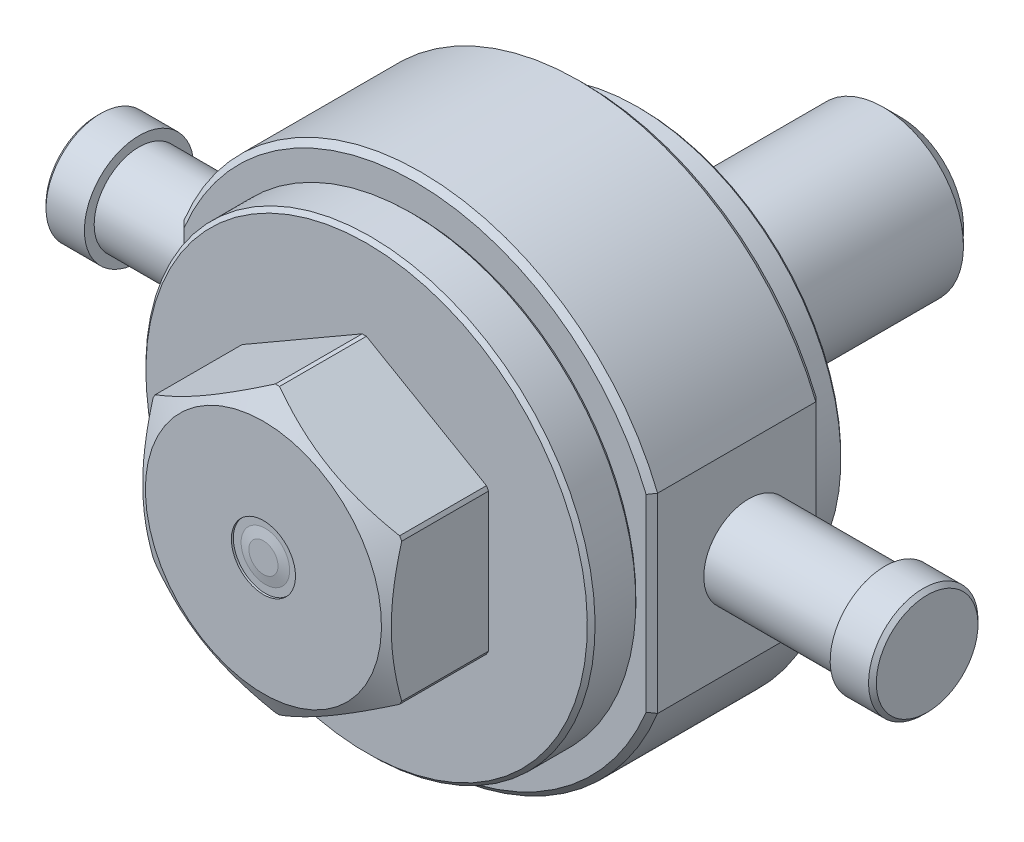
ISO-10303-21;
HEADER;
FILE_DESCRIPTION(('STEP AP214'),'2;1');
FILE_NAME('part.step','',(''),(''),'','','');
FILE_SCHEMA(('AUTOMOTIVE_DESIGN { 1 0 10303 214 1 1 1 1 }'));
ENDSEC;
DATA;
#1=APPLICATION_CONTEXT('core data for automotive mechanical design processes');
#2=APPLICATION_PROTOCOL_DEFINITION('international standard','automotive_design',2000,#1);
#3=PRODUCT_CONTEXT('',#1,'mechanical');
#4=PRODUCT('Part','Part','',(#3));
#5=PRODUCT_RELATED_PRODUCT_CATEGORY('part','',(#4));
#6=PRODUCT_DEFINITION_FORMATION('','',#4);
#7=PRODUCT_DEFINITION_CONTEXT('part definition',#1,'design');
#8=PRODUCT_DEFINITION('design','',#6,#7);
#9=PRODUCT_DEFINITION_SHAPE('','',#8);
#10=(LENGTH_UNIT() NAMED_UNIT(*) SI_UNIT(.MILLI.,.METRE.));
#11=(NAMED_UNIT(*) PLANE_ANGLE_UNIT() SI_UNIT($,.RADIAN.));
#12=(NAMED_UNIT(*) SI_UNIT($,.STERADIAN.) SOLID_ANGLE_UNIT());
#13=UNCERTAINTY_MEASURE_WITH_UNIT(LENGTH_MEASURE(1.E-05),#10,'distance_accuracy_value','');
#14=(GEOMETRIC_REPRESENTATION_CONTEXT(3) GLOBAL_UNCERTAINTY_ASSIGNED_CONTEXT((#13)) GLOBAL_UNIT_ASSIGNED_CONTEXT((#10,
#11,#12)) REPRESENTATION_CONTEXT('',''));
#15=CARTESIAN_POINT('',(0.,0.,0.));
#16=DIRECTION('',(0.,0.,1.));
#17=DIRECTION('',(1.,0.,0.));
#18=AXIS2_PLACEMENT_3D('',#15,#16,#17);
#19=CARTESIAN_POINT('',(-61.9,0.,98.6791030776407));
#20=DIRECTION('',(-1.,0.,0.));
#21=DIRECTION('',(0.,0.,1.));
#22=AXIS2_PLACEMENT_3D('',#19,#20,#21);
#23=PLANE('',#22);
#24=DIRECTION('',(0.,0.,-1.));
#25=VECTOR('',#24,1.);
#26=CARTESIAN_POINT('',(-61.9,24.9482941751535,58.8772));
#27=LINE('',#26,#25);
#28=CARTESIAN_POINT('',(-61.9,24.9482941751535,16.0034));
#29=VERTEX_POINT('',#28);
#30=CARTESIAN_POINT('',(-61.9,24.9482941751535,57.3772));
#31=VERTEX_POINT('',#30);
#32=EDGE_CURVE('E298',#29,#31,#27,.F.);
#33=ORIENTED_EDGE('',*,*,#32,.F.);
#34=DIRECTION('',(0.,-1.,0.));
#35=VECTOR('',#34,1.);
#36=CARTESIAN_POINT('',(-61.9,-20.6022300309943,16.0034));
#37=LINE('',#36,#35);
#38=CARTESIAN_POINT('',(-61.9,-24.9482941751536,16.0034));
#39=VERTEX_POINT('',#38);
#40=EDGE_CURVE('E343',#29,#39,#37,.T.);
#41=ORIENTED_EDGE('',*,*,#40,.T.);
#42=DIRECTION('',(0.,0.,-1.));
#43=VECTOR('',#42,1.);
#44=CARTESIAN_POINT('',(-61.9,-24.9482941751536,58.8772));
#45=LINE('',#44,#43);
#46=CARTESIAN_POINT('',(-61.9,-24.9482941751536,57.3772));
#47=VERTEX_POINT('',#46);
#48=EDGE_CURVE('E186',#39,#47,#45,.F.);
#49=ORIENTED_EDGE('',*,*,#48,.T.);
#50=DIRECTION('',(0.,1.,0.));
#51=VECTOR('',#50,1.);
#52=CARTESIAN_POINT('',(-61.9,0.,57.3772));
#53=LINE('',#52,#51);
#54=EDGE_CURVE('E341',#47,#31,#53,.T.);
#55=ORIENTED_EDGE('',*,*,#54,.T.);
#56=EDGE_LOOP('',(#33,#41,#49,#55));
#57=FACE_BOUND('',#56,.T.);
#58=CARTESIAN_POINT('',(-61.9,0.,33.5534));
#59=DIRECTION('',(-1.,0.,0.));
#60=DIRECTION('',(0.,0.,1.));
#61=AXIS2_PLACEMENT_3D('',#58,#59,#60);
#62=CIRCLE('',#61,11.75);
#63=CARTESIAN_POINT('',(-61.9,0.,45.3034));
#64=VERTEX_POINT('',#63);
#65=EDGE_CURVE('E236',#64,#64,#62,.F.);
#66=ORIENTED_EDGE('',*,*,#65,.T.);
#67=EDGE_LOOP('',(#66));
#68=FACE_BOUND('',#67,.T.);
#69=ADVANCED_FACE('F14',(#57,#68),#23,.T.);
#70=CARTESIAN_POINT('',(61.9,0.,98.6791030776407));
#71=DIRECTION('',(1.,0.,0.));
#72=DIRECTION('',(0.,0.,-1.));
#73=AXIS2_PLACEMENT_3D('',#70,#71,#72);
#74=PLANE('',#73);
#75=DIRECTION('',(0.,0.,-1.));
#76=VECTOR('',#75,1.);
#77=CARTESIAN_POINT('',(61.9,-24.9482941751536,58.8772));
#78=LINE('',#77,#76);
#79=CARTESIAN_POINT('',(61.9,-24.9482941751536,57.3772));
#80=VERTEX_POINT('',#79);
#81=CARTESIAN_POINT('',(61.9,-24.9482941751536,16.0034));
#82=VERTEX_POINT('',#81);
#83=EDGE_CURVE('E168',#80,#82,#78,.T.);
#84=ORIENTED_EDGE('',*,*,#83,.T.);
#85=DIRECTION('',(0.,1.,0.));
#86=VECTOR('',#85,1.);
#87=CARTESIAN_POINT('',(61.9,20.6022300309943,16.0034));
#88=LINE('',#87,#86);
#89=CARTESIAN_POINT('',(61.9,24.9482941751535,16.0034));
#90=VERTEX_POINT('',#89);
#91=EDGE_CURVE('E174',#82,#90,#88,.T.);
#92=ORIENTED_EDGE('',*,*,#91,.T.);
#93=DIRECTION('',(0.,0.,-1.));
#94=VECTOR('',#93,1.);
#95=CARTESIAN_POINT('',(61.9,24.9482941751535,58.8772));
#96=LINE('',#95,#94);
#97=CARTESIAN_POINT('',(61.9,24.9482941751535,57.3772));
#98=VERTEX_POINT('',#97);
#99=EDGE_CURVE('E171',#98,#90,#96,.T.);
#100=ORIENTED_EDGE('',*,*,#99,.F.);
#101=DIRECTION('',(0.,-1.,0.));
#102=VECTOR('',#101,1.);
#103=CARTESIAN_POINT('',(61.9,0.,57.3772));
#104=LINE('',#103,#102);
#105=EDGE_CURVE('E163',#98,#80,#104,.T.);
#106=ORIENTED_EDGE('',*,*,#105,.T.);
#107=EDGE_LOOP('',(#84,#92,#100,#106));
#108=FACE_BOUND('',#107,.T.);
#109=CARTESIAN_POINT('',(61.9,0.,33.5534));
#110=DIRECTION('',(1.,0.,0.));
#111=DIRECTION('',(0.,0.,-1.));
#112=AXIS2_PLACEMENT_3D('',#109,#110,#111);
#113=CIRCLE('',#112,11.75);
#114=CARTESIAN_POINT('',(61.9,0.,21.8034));
#115=VERTEX_POINT('',#114);
#116=EDGE_CURVE('E240',#115,#115,#113,.F.);
#117=ORIENTED_EDGE('',*,*,#116,.T.);
#118=EDGE_LOOP('',(#117));
#119=FACE_BOUND('',#118,.T.);
#120=ADVANCED_FACE('F165',(#108,#119),#74,.T.);
#121=CARTESIAN_POINT('',(141.793618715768,0.,33.5534));
#122=DIRECTION('',(-1.,0.,0.));
#123=DIRECTION('',(0.,-1.,0.));
#124=AXIS2_PLACEMENT_3D('',#121,#122,#123);
#125=CYLINDRICAL_SURFACE('',#124,11.75);
#126=ORIENTED_EDGE('',*,*,#116,.F.);
#127=EDGE_LOOP('',(#126));
#128=FACE_BOUND('',#127,.T.);
#129=CARTESIAN_POINT('',(97.5106,0.,33.5534));
#130=DIRECTION('',(-1.,0.,0.));
#131=DIRECTION('',(0.,-1.,0.));
#132=AXIS2_PLACEMENT_3D('',#129,#130,#131);
#133=CIRCLE('',#132,11.75);
#134=CARTESIAN_POINT('',(97.5106,-11.7499999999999,33.5534));
#135=VERTEX_POINT('',#134);
#136=EDGE_CURVE('E251',#135,#135,#133,.T.);
#137=ORIENTED_EDGE('',*,*,#136,.T.);
#138=EDGE_LOOP('',(#137));
#139=FACE_BOUND('',#138,.T.);
#140=ADVANCED_FACE('F355',(#128,#139),#125,.T.);
#141=CARTESIAN_POINT('',(0.,0.,58.8772));
#142=DIRECTION('',(0.,0.,1.));
#143=DIRECTION('',(0.,-1.,0.));
#144=AXIS2_PLACEMENT_3D('',#141,#142,#143);
#145=PLANE('',#144);
#146=CARTESIAN_POINT('',(0.,0.,58.8772));
#147=DIRECTION('',(0.,0.,1.));
#148=DIRECTION('',(1.,0.,0.));
#149=AXIS2_PLACEMENT_3D('',#146,#147,#148);
#150=CIRCLE('',#149,65.2385);
#151=CARTESIAN_POINT('',(60.4,24.6556663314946,58.8772));
#152=VERTEX_POINT('',#151);
#153=CARTESIAN_POINT('',(-60.4,24.6556663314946,58.8772));
#154=VERTEX_POINT('',#153);
#155=EDGE_CURVE('E232',#152,#154,#150,.T.);
#156=ORIENTED_EDGE('',*,*,#155,.T.);
#157=DIRECTION('',(0.,-1.,0.));
#158=VECTOR('',#157,1.);
#159=CARTESIAN_POINT('',(-60.4,0.,58.8772));
#160=LINE('',#159,#158);
#161=CARTESIAN_POINT('',(-60.4,-24.6556663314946,58.8772));
#162=VERTEX_POINT('',#161);
#163=EDGE_CURVE('E199',#154,#162,#160,.T.);
#164=ORIENTED_EDGE('',*,*,#163,.T.);
#165=CARTESIAN_POINT('',(60.4,-24.6556663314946,58.8772));
#166=VERTEX_POINT('',#165);
#167=EDGE_CURVE('E235',#162,#166,#150,.T.);
#168=ORIENTED_EDGE('',*,*,#167,.T.);
#169=DIRECTION('',(0.,1.,0.));
#170=VECTOR('',#169,1.);
#171=CARTESIAN_POINT('',(60.4,0.,58.8772));
#172=LINE('',#171,#170);
#173=EDGE_CURVE('E198',#166,#152,#172,.T.);
#174=ORIENTED_EDGE('',*,*,#173,.T.);
#175=EDGE_LOOP('',(#156,#164,#168,#174));
#176=FACE_BOUND('',#175,.T.);
#177=CARTESIAN_POINT('',(0.,0.,58.8772));
#178=DIRECTION('',(0.,0.,1.));
#179=DIRECTION('',(0.,-1.,0.));
#180=AXIS2_PLACEMENT_3D('',#177,#178,#179);
#181=CIRCLE('',#180,57.7215);
#182=CARTESIAN_POINT('',(0.,-57.7215,58.8772));
#183=VERTEX_POINT('',#182);
#184=EDGE_CURVE('E1003',#183,#183,#181,.F.);
#185=ORIENTED_EDGE('',*,*,#184,.T.);
#186=EDGE_LOOP('',(#185));
#187=FACE_BOUND('',#186,.T.);
#188=ADVANCED_FACE('F218',(#176,#187),#145,.T.);
#189=CARTESIAN_POINT('',(0.,0.,57.3772));
#190=DIRECTION('',(0.,0.,-1.));
#191=DIRECTION('',(-1.,0.,0.));
#192=AXIS2_PLACEMENT_3D('',#189,#190,#191);
#193=CONICAL_SURFACE('',#192,66.7385,0.785398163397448);
#194=CARTESIAN_POINT('',(0.,0.,57.3772));
#195=DIRECTION('',(0.,0.,1.));
#196=DIRECTION('',(1.,0.,0.));
#197=AXIS2_PLACEMENT_3D('',#194,#195,#196);
#198=CIRCLE('',#197,66.7385);
#199=EDGE_CURVE('E196',#98,#31,#198,.T.);
#200=ORIENTED_EDGE('',*,*,#199,.T.);
#201=CARTESIAN_POINT('',(-61.9,24.9482941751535,57.3772));
#202=CARTESIAN_POINT('',(-61.6499724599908,24.89980521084,57.6272275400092));
#203=CARTESIAN_POINT('',(-61.3999586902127,24.8511750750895,57.8772413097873));
#204=CARTESIAN_POINT('',(-60.8999586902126,24.7536324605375,58.3772413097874));
#205=CARTESIAN_POINT('',(-60.6499724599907,24.704719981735,58.6272275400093));
#206=CARTESIAN_POINT('',(-60.4,24.6556663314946,58.8772));
#207=B_SPLINE_CURVE_WITH_KNOTS('',3,(#201,#202,#203,#204,#205,#206),.UNSPECIFIED.,.F.,.F.,(4,2,
4),(0.,1.07070441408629,2.14140883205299),.UNSPECIFIED.);
#208=EDGE_CURVE('E9',#31,#154,#207,.T.);
#209=ORIENTED_EDGE('',*,*,#208,.T.);
#210=ORIENTED_EDGE('',*,*,#155,.F.);
#211=CARTESIAN_POINT('',(60.4,24.6556663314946,58.8772));
#212=CARTESIAN_POINT('',(60.6499724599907,24.704719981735,58.6272275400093));
#213=CARTESIAN_POINT('',(60.8999586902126,24.7536324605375,58.3772413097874));
#214=CARTESIAN_POINT('',(61.3999586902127,24.8511750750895,57.8772413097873));
#215=CARTESIAN_POINT('',(61.6499724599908,24.89980521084,57.6272275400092));
#216=CARTESIAN_POINT('',(61.9,24.9482941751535,57.3772));
#217=B_SPLINE_CURVE_WITH_KNOTS('',3,(#211,#212,#213,#214,#215,#216),.UNSPECIFIED.,.F.,.F.,(4,2,
4),(0.,1.0707044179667,2.14140883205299),.UNSPECIFIED.);
#218=EDGE_CURVE('E28',#152,#98,#217,.T.);
#219=ORIENTED_EDGE('',*,*,#218,.T.);
#220=EDGE_LOOP('',(#200,#209,#210,#219));
#221=FACE_BOUND('',#220,.T.);
#222=ADVANCED_FACE('F213',(#221),#193,.T.);
#223=ORIENTED_EDGE('',*,*,#167,.F.);
#224=CARTESIAN_POINT('',(-60.4,-24.6556663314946,58.8772));
#225=CARTESIAN_POINT('',(-60.6499724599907,-24.704719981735,58.6272275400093));
#226=CARTESIAN_POINT('',(-60.8999586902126,-24.7536324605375,58.3772413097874));
#227=CARTESIAN_POINT('',(-61.3999586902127,-24.8511750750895,57.8772413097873));
#228=CARTESIAN_POINT('',(-61.6499724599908,-24.89980521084,57.6272275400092));
#229=CARTESIAN_POINT('',(-61.9,-24.9482941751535,57.3772));
#230=B_SPLINE_CURVE_WITH_KNOTS('',3,(#224,#225,#226,#227,#228,#229),.UNSPECIFIED.,.F.,.F.,(4,2,
4),(0.,1.0707044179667,2.14140883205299),.UNSPECIFIED.);
#231=EDGE_CURVE('E193',#162,#47,#230,.T.);
#232=ORIENTED_EDGE('',*,*,#231,.T.);
#233=EDGE_CURVE('E181',#47,#80,#198,.T.);
#234=ORIENTED_EDGE('',*,*,#233,.T.);
#235=CARTESIAN_POINT('',(61.9,-24.9482941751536,57.3772));
#236=CARTESIAN_POINT('',(61.6499724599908,-24.89980521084,57.6272275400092));
#237=CARTESIAN_POINT('',(61.3999586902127,-24.8511750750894,57.8772413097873));
#238=CARTESIAN_POINT('',(60.8999586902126,-24.7536324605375,58.3772413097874));
#239=CARTESIAN_POINT('',(60.6499724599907,-24.704719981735,58.6272275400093));
#240=CARTESIAN_POINT('',(60.4,-24.6556663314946,58.8772));
#241=B_SPLINE_CURVE_WITH_KNOTS('',3,(#235,#236,#237,#238,#239,#240),.UNSPECIFIED.,.F.,.F.,(4,2,
4),(0.,1.0707044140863,2.141408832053),.UNSPECIFIED.);
#242=EDGE_CURVE('E191',#80,#166,#241,.T.);
#243=ORIENTED_EDGE('',*,*,#242,.T.);
#244=EDGE_LOOP('',(#223,#232,#234,#243));
#245=FACE_BOUND('',#244,.T.);
#246=ADVANCED_FACE('F190',(#245),#193,.T.);
#247=CARTESIAN_POINT('',(0.,0.,14.5034));
#248=DIRECTION('',(0.,0.,1.));
#249=DIRECTION('',(1.,0.,0.));
#250=AXIS2_PLACEMENT_3D('',#247,#248,#249);
#251=CONICAL_SURFACE('',#250,65.2385,0.785398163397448);
#252=CARTESIAN_POINT('',(0.,0.,16.0034));
#253=DIRECTION('',(0.,0.,1.));
#254=DIRECTION('',(1.,0.,0.));
#255=AXIS2_PLACEMENT_3D('',#252,#253,#254);
#256=CIRCLE('',#255,66.7385);
#257=EDGE_CURVE('E247',#90,#29,#256,.T.);
#258=ORIENTED_EDGE('',*,*,#257,.F.);
#259=CARTESIAN_POINT('',(61.9,24.9482941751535,16.0034));
#260=CARTESIAN_POINT('',(61.6499724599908,24.89980521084,15.7533724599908));
#261=CARTESIAN_POINT('',(61.3999586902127,24.8511750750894,15.5033586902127));
#262=CARTESIAN_POINT('',(60.8999586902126,24.7536324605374,15.0033586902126));
#263=CARTESIAN_POINT('',(60.6499724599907,24.7047199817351,14.7533724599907));
#264=CARTESIAN_POINT('',(60.4,24.6556663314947,14.5034));
#265=B_SPLINE_CURVE_WITH_KNOTS('',3,(#259,#260,#261,#262,#263,#264),.UNSPECIFIED.,.F.,.F.,(4,2,
4),(0.,1.07070441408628,2.14140883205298),.UNSPECIFIED.);
#266=CARTESIAN_POINT('',(60.4,24.6556663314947,14.5034));
#267=VERTEX_POINT('',#266);
#268=EDGE_CURVE('E309',#90,#267,#265,.T.);
#269=ORIENTED_EDGE('',*,*,#268,.T.);
#270=CARTESIAN_POINT('',(0.,0.,14.5034));
#271=DIRECTION('',(0.,0.,1.));
#272=DIRECTION('',(1.,0.,0.));
#273=AXIS2_PLACEMENT_3D('',#270,#271,#272);
#274=CIRCLE('',#273,65.2385);
#275=CARTESIAN_POINT('',(-60.4,24.6556663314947,14.5034));
#276=VERTEX_POINT('',#275);
#277=EDGE_CURVE('E238',#267,#276,#274,.T.);
#278=ORIENTED_EDGE('',*,*,#277,.T.);
#279=CARTESIAN_POINT('',(-60.4,24.6556663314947,14.5034));
#280=CARTESIAN_POINT('',(-60.6499724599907,24.7047199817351,14.7533724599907));
#281=CARTESIAN_POINT('',(-60.8999586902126,24.7536324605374,15.0033586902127));
#282=CARTESIAN_POINT('',(-61.3999586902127,24.8511750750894,15.5033586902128));
#283=CARTESIAN_POINT('',(-61.6499724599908,24.89980521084,15.7533724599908));
#284=CARTESIAN_POINT('',(-61.9,24.9482941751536,16.0034));
#285=B_SPLINE_CURVE_WITH_KNOTS('',3,(#279,#280,#281,#282,#283,#284),.UNSPECIFIED.,.F.,.F.,(4,2,
4),(0.,1.07070441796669,2.14140883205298),.UNSPECIFIED.);
#286=EDGE_CURVE('E302',#276,#29,#285,.T.);
#287=ORIENTED_EDGE('',*,*,#286,.T.);
#288=EDGE_LOOP('',(#258,#269,#278,#287));
#289=FACE_BOUND('',#288,.T.);
#290=ADVANCED_FACE('F219',(#289),#251,.T.);
#291=CARTESIAN_POINT('',(-60.4,-24.6556663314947,14.5034));
#292=VERTEX_POINT('',#291);
#293=CARTESIAN_POINT('',(60.4,-24.6556663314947,14.5034));
#294=VERTEX_POINT('',#293);
#295=EDGE_CURVE('E244',#292,#294,#274,.T.);
#296=ORIENTED_EDGE('',*,*,#295,.T.);
#297=CARTESIAN_POINT('',(60.4,-24.6556663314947,14.5034));
#298=CARTESIAN_POINT('',(60.6499724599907,-24.7047199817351,14.7533724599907));
#299=CARTESIAN_POINT('',(60.8999586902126,-24.7536324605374,15.0033586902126));
#300=CARTESIAN_POINT('',(61.3999586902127,-24.8511750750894,15.5033586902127));
#301=CARTESIAN_POINT('',(61.6499724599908,-24.89980521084,15.7533724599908));
#302=CARTESIAN_POINT('',(61.9,-24.9482941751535,16.0034));
#303=B_SPLINE_CURVE_WITH_KNOTS('',3,(#297,#298,#299,#300,#301,#302),.UNSPECIFIED.,.F.,.F.,(4,2,
4),(0.,1.07070441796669,2.14140883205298),.UNSPECIFIED.);
#304=EDGE_CURVE('E334',#294,#82,#303,.T.);
#305=ORIENTED_EDGE('',*,*,#304,.T.);
#306=EDGE_CURVE('E184',#39,#82,#256,.T.);
#307=ORIENTED_EDGE('',*,*,#306,.F.);
#308=CARTESIAN_POINT('',(-61.9,-24.9482941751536,16.0034));
#309=CARTESIAN_POINT('',(-61.6499724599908,-24.89980521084,15.7533724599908));
#310=CARTESIAN_POINT('',(-61.3999586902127,-24.8511750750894,15.5033586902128));
#311=CARTESIAN_POINT('',(-60.8999586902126,-24.7536324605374,15.0033586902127));
#312=CARTESIAN_POINT('',(-60.6499724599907,-24.7047199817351,14.7533724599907));
#313=CARTESIAN_POINT('',(-60.4,-24.6556663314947,14.5034));
#314=B_SPLINE_CURVE_WITH_KNOTS('',3,(#308,#309,#310,#311,#312,#313),.UNSPECIFIED.,.F.,.F.,(4,2,
4),(0.,1.07070441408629,2.14140883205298),.UNSPECIFIED.);
#315=EDGE_CURVE('E327',#39,#292,#314,.T.);
#316=ORIENTED_EDGE('',*,*,#315,.T.);
#317=EDGE_LOOP('',(#296,#305,#307,#316));
#318=FACE_BOUND('',#317,.T.);
#319=ADVANCED_FACE('F417',(#318),#251,.T.);
#320=CARTESIAN_POINT('',(0.,0.,14.5034));
#321=DIRECTION('',(0.,0.,1.));
#322=DIRECTION('',(0.,-1.,0.));
#323=AXIS2_PLACEMENT_3D('',#320,#321,#322);
#324=PLANE('',#323);
#325=CARTESIAN_POINT('',(0.,0.,14.5034));
#326=DIRECTION('',(0.,0.,-1.));
#327=DIRECTION('',(0.,1.,0.));
#328=AXIS2_PLACEMENT_3D('',#325,#326,#327);
#329=CIRCLE('',#328,31.7545429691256);
#330=CARTESIAN_POINT('',(0.,31.7545429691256,14.5034));
#331=VERTEX_POINT('',#330);
#332=EDGE_CURVE('E295',#331,#331,#329,.T.);
#333=ORIENTED_EDGE('',*,*,#332,.F.);
#334=EDGE_LOOP('',(#333));
#335=FACE_BOUND('',#334,.T.);
#336=ORIENTED_EDGE('',*,*,#277,.F.);
#337=DIRECTION('',(0.,-1.,0.));
#338=VECTOR('',#337,1.);
#339=CARTESIAN_POINT('',(60.4,-20.6022300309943,14.5034));
#340=LINE('',#339,#338);
#341=EDGE_CURVE('E335',#267,#294,#340,.T.);
#342=ORIENTED_EDGE('',*,*,#341,.T.);
#343=ORIENTED_EDGE('',*,*,#295,.F.);
#344=DIRECTION('',(0.,1.,0.));
#345=VECTOR('',#344,1.);
#346=CARTESIAN_POINT('',(-60.4,20.6022300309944,14.5034));
#347=LINE('',#346,#345);
#348=EDGE_CURVE('E1182',#292,#276,#347,.T.);
#349=ORIENTED_EDGE('',*,*,#348,.T.);
#350=EDGE_LOOP('',(#336,#342,#343,#349));
#351=FACE_BOUND('',#350,.T.);
#352=ADVANCED_FACE('F270',(#335,#351),#324,.F.);
#353=CARTESIAN_POINT('',(0.,0.,58.8772));
#354=DIRECTION('',(0.,0.,-1.));
#355=DIRECTION('',(0.,1.,0.));
#356=AXIS2_PLACEMENT_3D('',#353,#354,#355);
#357=CYLINDRICAL_SURFACE('',#356,66.7385);
#358=ORIENTED_EDGE('',*,*,#199,.F.);
#359=ORIENTED_EDGE('',*,*,#99,.T.);
#360=ORIENTED_EDGE('',*,*,#257,.T.);
#361=ORIENTED_EDGE('',*,*,#32,.T.);
#362=EDGE_LOOP('',(#358,#359,#360,#361));
#363=FACE_BOUND('',#362,.T.);
#364=ADVANCED_FACE('F272',(#363),#357,.T.);
#365=ORIENTED_EDGE('',*,*,#83,.F.);
#366=ORIENTED_EDGE('',*,*,#233,.F.);
#367=ORIENTED_EDGE('',*,*,#48,.F.);
#368=ORIENTED_EDGE('',*,*,#306,.T.);
#369=EDGE_LOOP('',(#365,#366,#367,#368));
#370=FACE_BOUND('',#369,.T.);
#371=ADVANCED_FACE('F179',(#370),#357,.T.);
#372=CARTESIAN_POINT('',(-97.5106,0.,33.5534));
#373=DIRECTION('',(1.,0.,0.));
#374=DIRECTION('',(0.,1.,0.));
#375=AXIS2_PLACEMENT_3D('',#372,#373,#374);
#376=CIRCLE('',#375,11.75);
#377=CARTESIAN_POINT('',(-97.5106,11.75,33.5534));
#378=VERTEX_POINT('',#377);
#379=EDGE_CURVE('E254',#378,#378,#376,.T.);
#380=ORIENTED_EDGE('',*,*,#379,.T.);
#381=EDGE_LOOP('',(#380));
#382=FACE_BOUND('',#381,.T.);
#383=ORIENTED_EDGE('',*,*,#65,.F.);
#384=EDGE_LOOP('',(#383));
#385=FACE_BOUND('',#384,.T.);
#386=ADVANCED_FACE('F358',(#382,#385),#125,.T.);
#387=CARTESIAN_POINT('',(30.8737,0.,98.552));
#388=DIRECTION('',(0.,0.,-1.));
#389=DIRECTION('',(1.,0.,0.));
#390=AXIS2_PLACEMENT_3D('',#387,#388,#389);
#391=PLANE('',#390);
#392=CARTESIAN_POINT('',(0.,0.,98.5520000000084));
#393=DIRECTION('',(0.,0.,-1.));
#394=DIRECTION('',(0.,1.,0.));
#395=AXIS2_PLACEMENT_3D('',#392,#393,#394);
#396=CIRCLE('',#395,3.80999999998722);
#397=CARTESIAN_POINT('',(0.,3.80999999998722,98.5520000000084));
#398=VERTEX_POINT('',#397);
#399=EDGE_CURVE('E257',#398,#398,#396,.T.);
#400=ORIENTED_EDGE('',*,*,#399,.F.);
#401=EDGE_LOOP('',(#400));
#402=FACE_BOUND('',#401,.T.);
#403=ADVANCED_FACE('F452',(#402),#391,.F.);
#404=CARTESIAN_POINT('',(0.,0.,98.0440000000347));
#405=DIRECTION('',(0.,0.,-1.));
#406=DIRECTION('',(0.,1.,0.));
#407=AXIS2_PLACEMENT_3D('',#404,#405,#406);
#408=CONICAL_SURFACE('',#407,6.34999999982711,1.37340076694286);
#409=ORIENTED_EDGE('',*,*,#399,.T.);
#410=EDGE_LOOP('',(#409));
#411=FACE_BOUND('',#410,.T.);
#412=CARTESIAN_POINT('',(0.,0.,98.0439999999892));
#413=DIRECTION('',(0.,0.,-1.));
#414=DIRECTION('',(0.,1.,0.));
#415=AXIS2_PLACEMENT_3D('',#412,#413,#414);
#416=CIRCLE('',#415,6.35000000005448);
#417=CARTESIAN_POINT('',(0.,6.35000000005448,98.0439999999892));
#418=VERTEX_POINT('',#417);
#419=EDGE_CURVE('E1088',#418,#418,#416,.F.);
#420=ORIENTED_EDGE('',*,*,#419,.T.);
#421=EDGE_LOOP('',(#420));
#422=FACE_BOUND('',#421,.T.);
#423=ADVANCED_FACE('F461',(#411,#422),#408,.T.);
#424=CARTESIAN_POINT('',(-6.35,0.,98.044));
#425=DIRECTION('',(0.,0.,-1.));
#426=DIRECTION('',(0.,1.,0.));
#427=AXIS2_PLACEMENT_3D('',#424,#425,#426);
#428=PLANE('',#427);
#429=CARTESIAN_POINT('',(0.,0.,98.044));
#430=DIRECTION('',(0.,0.,1.));
#431=DIRECTION('',(0.,-1.,0.));
#432=AXIS2_PLACEMENT_3D('',#429,#430,#431);
#433=CIRCLE('',#432,8.382);
#434=CARTESIAN_POINT('',(0.,-8.382,98.044));
#435=VERTEX_POINT('',#434);
#436=EDGE_CURVE('E1085',#435,#435,#433,.T.);
#437=ORIENTED_EDGE('',*,*,#436,.T.);
#438=EDGE_LOOP('',(#437));
#439=FACE_BOUND('',#438,.T.);
#440=ORIENTED_EDGE('',*,*,#419,.F.);
#441=EDGE_LOOP('',(#440));
#442=FACE_BOUND('',#441,.T.);
#443=ADVANCED_FACE('F471',(#439,#442),#428,.F.);
#444=CARTESIAN_POINT('',(0.,0.,228.645427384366));
#445=DIRECTION('',(0.,0.,1.));
#446=DIRECTION('',(0.,-1.,0.));
#447=AXIS2_PLACEMENT_3D('',#444,#445,#446);
#448=CYLINDRICAL_SURFACE('',#447,8.382);
#449=ORIENTED_EDGE('',*,*,#436,.F.);
#450=EDGE_LOOP('',(#449));
#451=FACE_BOUND('',#450,.T.);
#452=CARTESIAN_POINT('',(0.,0.,98.552));
#453=DIRECTION('',(0.,0.,1.));
#454=DIRECTION('',(0.,-1.,0.));
#455=AXIS2_PLACEMENT_3D('',#452,#453,#454);
#456=CIRCLE('',#455,8.382);
#457=CARTESIAN_POINT('',(0.,-8.382,98.552));
#458=VERTEX_POINT('',#457);
#459=EDGE_CURVE('E1082',#458,#458,#456,.T.);
#460=ORIENTED_EDGE('',*,*,#459,.T.);
#461=EDGE_LOOP('',(#460));
#462=FACE_BOUND('',#461,.T.);
#463=ADVANCED_FACE('F480',(#451,#462),#448,.F.);
#464=CARTESIAN_POINT('',(30.8737,0.,98.552));
#465=DIRECTION('',(0.,0.,-1.));
#466=DIRECTION('',(1.,0.,0.));
#467=AXIS2_PLACEMENT_3D('',#464,#465,#466);
#468=PLANE('',#467);
#469=ORIENTED_EDGE('',*,*,#459,.F.);
#470=EDGE_LOOP('',(#469));
#471=FACE_BOUND('',#470,.T.);
#472=CARTESIAN_POINT('',(0.,0.,98.552));
#473=DIRECTION('',(0.,0.,-1.));
#474=DIRECTION('',(0.,1.,0.));
#475=AXIS2_PLACEMENT_3D('',#472,#473,#474);
#476=CIRCLE('',#475,30.8737);
#477=CARTESIAN_POINT('',(0.,30.8737,98.552));
#478=VERTEX_POINT('',#477);
#479=EDGE_CURVE('E994',#478,#478,#476,.T.);
#480=ORIENTED_EDGE('',*,*,#479,.F.);
#481=EDGE_LOOP('',(#480));
#482=FACE_BOUND('',#481,.T.);
#483=ADVANCED_FACE('F489',(#471,#482),#468,.F.);
#484=CARTESIAN_POINT('',(0.,0.,248.489609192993));
#485=DIRECTION('',(0.,0.,1.));
#486=DIRECTION('',(-1.,0.,0.));
#487=AXIS2_PLACEMENT_3D('',#484,#485,#486);
#488=CYLINDRICAL_SURFACE('',#487,37.211);
#489=DIRECTION('',(0.,0.,1.));
#490=VECTOR('',#489,1.);
#491=CARTESIAN_POINT('',(-31.9448886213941,19.0835691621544,-68.3768));
#492=LINE('',#491,#490);
#493=CARTESIAN_POINT('',(-31.9448886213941,19.0835691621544,72.1868));
#494=VERTEX_POINT('',#493);
#495=CARTESIAN_POINT('',(-31.9448886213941,19.0835691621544,94.8931581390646));
#496=VERTEX_POINT('',#495);
#497=EDGE_CURVE('E929',#494,#496,#492,.T.);
#498=ORIENTED_EDGE('',*,*,#497,.F.);
#499=CARTESIAN_POINT('',(0.,0.,72.1868));
#500=DIRECTION('',(0.,0.,1.));
#501=DIRECTION('',(-1.,0.,0.));
#502=AXIS2_PLACEMENT_3D('',#499,#500,#501);
#503=CIRCLE('',#502,37.211);
#504=CARTESIAN_POINT('',(-32.4993,18.1233004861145,72.1868));
#505=VERTEX_POINT('',#504);
#506=EDGE_CURVE('E1080',#494,#505,#503,.T.);
#507=ORIENTED_EDGE('',*,*,#506,.T.);
#508=DIRECTION('',(0.,0.,1.));
#509=VECTOR('',#508,1.);
#510=CARTESIAN_POINT('',(-32.4993,18.1233004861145,-68.3768));
#511=LINE('',#510,#509);
#512=CARTESIAN_POINT('',(-32.4993,18.1233004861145,94.8931581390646));
#513=VERTEX_POINT('',#512);
#514=EDGE_CURVE('E928',#513,#505,#511,.F.);
#515=ORIENTED_EDGE('',*,*,#514,.F.);
#516=CARTESIAN_POINT('',(0.,0.,94.8931581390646));
#517=DIRECTION('',(0.,0.,-1.));
#518=DIRECTION('',(1.,0.,0.));
#519=AXIS2_PLACEMENT_3D('',#516,#517,#518);
#520=CIRCLE('',#519,37.211);
#521=EDGE_CURVE('E984',#496,#513,#520,.F.);
#522=ORIENTED_EDGE('',*,*,#521,.F.);
#523=EDGE_LOOP('',(#498,#507,#515,#522));
#524=FACE_BOUND('',#523,.T.);
#525=ADVANCED_FACE('F498',(#524),#488,.T.);
#526=CARTESIAN_POINT('',(0.,0.,248.489609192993));
#527=DIRECTION('',(0.,0.,1.));
#528=DIRECTION('',(-1.,0.,0.));
#529=AXIS2_PLACEMENT_3D('',#526,#527,#528);
#530=CYLINDRICAL_SURFACE('',#529,37.211);
#531=DIRECTION('',(0.,0.,1.));
#532=VECTOR('',#531,1.);
#533=CARTESIAN_POINT('',(-32.4993,-18.1233004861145,-68.3768));
#534=LINE('',#533,#532);
#535=CARTESIAN_POINT('',(-32.4993,-18.1233004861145,72.1868));
#536=VERTEX_POINT('',#535);
#537=CARTESIAN_POINT('',(-32.4993,-18.1233004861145,94.8931581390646));
#538=VERTEX_POINT('',#537);
#539=EDGE_CURVE('E967',#536,#538,#534,.T.);
#540=ORIENTED_EDGE('',*,*,#539,.F.);
#541=CARTESIAN_POINT('',(0.,0.,72.1868));
#542=DIRECTION('',(0.,0.,1.));
#543=DIRECTION('',(-1.,0.,0.));
#544=AXIS2_PLACEMENT_3D('',#541,#542,#543);
#545=CIRCLE('',#544,37.211);
#546=CARTESIAN_POINT('',(-31.9448886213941,-19.0835691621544,72.1868));
#547=VERTEX_POINT('',#546);
#548=EDGE_CURVE('E1078',#536,#547,#545,.T.);
#549=ORIENTED_EDGE('',*,*,#548,.T.);
#550=DIRECTION('',(0.,0.,1.));
#551=VECTOR('',#550,1.);
#552=CARTESIAN_POINT('',(-31.9448886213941,-19.0835691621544,-68.3768));
#553=LINE('',#552,#551);
#554=CARTESIAN_POINT('',(-31.9448886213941,-19.0835691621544,94.8931581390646));
#555=VERTEX_POINT('',#554);
#556=EDGE_CURVE('E957',#555,#547,#553,.F.);
#557=ORIENTED_EDGE('',*,*,#556,.F.);
#558=CARTESIAN_POINT('',(0.,0.,94.8931581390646));
#559=DIRECTION('',(0.,0.,-1.));
#560=DIRECTION('',(1.,0.,0.));
#561=AXIS2_PLACEMENT_3D('',#558,#559,#560);
#562=CIRCLE('',#561,37.211);
#563=EDGE_CURVE('E990',#538,#555,#562,.F.);
#564=ORIENTED_EDGE('',*,*,#563,.F.);
#565=EDGE_LOOP('',(#540,#549,#557,#564));
#566=FACE_BOUND('',#565,.T.);
#567=ADVANCED_FACE('F507',(#566),#530,.T.);
#568=CARTESIAN_POINT('',(0.,0.,248.489609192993));
#569=DIRECTION('',(0.,0.,1.));
#570=DIRECTION('',(-1.,0.,0.));
#571=AXIS2_PLACEMENT_3D('',#568,#569,#570);
#572=CYLINDRICAL_SURFACE('',#571,37.211);
#573=DIRECTION('',(0.,0.,1.));
#574=VECTOR('',#573,1.);
#575=CARTESIAN_POINT('',(-0.554411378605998,-37.2068696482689,-68.3768));
#576=LINE('',#575,#574);
#577=CARTESIAN_POINT('',(-0.554411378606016,-37.2068696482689,72.1868));
#578=VERTEX_POINT('',#577);
#579=CARTESIAN_POINT('',(-0.554411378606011,-37.2068696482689,94.8931581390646));
#580=VERTEX_POINT('',#579);
#581=EDGE_CURVE('E946',#578,#580,#576,.T.);
#582=ORIENTED_EDGE('',*,*,#581,.F.);
#583=CARTESIAN_POINT('',(0.,0.,72.1868));
#584=DIRECTION('',(0.,0.,1.));
#585=DIRECTION('',(-1.,0.,0.));
#586=AXIS2_PLACEMENT_3D('',#583,#584,#585);
#587=CIRCLE('',#586,37.211);
#588=CARTESIAN_POINT('',(0.554411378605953,-37.2068696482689,72.1868));
#589=VERTEX_POINT('',#588);
#590=EDGE_CURVE('E992',#578,#589,#587,.T.);
#591=ORIENTED_EDGE('',*,*,#590,.T.);
#592=DIRECTION('',(0.,0.,1.));
#593=VECTOR('',#592,1.);
#594=CARTESIAN_POINT('',(0.554411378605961,-37.2068696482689,-68.3768));
#595=LINE('',#594,#593);
#596=CARTESIAN_POINT('',(0.554411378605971,-37.2068696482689,94.8931581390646));
#597=VERTEX_POINT('',#596);
#598=EDGE_CURVE('E945',#597,#589,#595,.F.);
#599=ORIENTED_EDGE('',*,*,#598,.F.);
#600=CARTESIAN_POINT('',(0.,0.,94.8931581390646));
#601=DIRECTION('',(0.,0.,-1.));
#602=DIRECTION('',(1.,0.,0.));
#603=AXIS2_PLACEMENT_3D('',#600,#601,#602);
#604=CIRCLE('',#603,37.211);
#605=EDGE_CURVE('E988',#580,#597,#604,.F.);
#606=ORIENTED_EDGE('',*,*,#605,.F.);
#607=EDGE_LOOP('',(#582,#591,#599,#606));
#608=FACE_BOUND('',#607,.T.);
#609=ADVANCED_FACE('F516',(#608),#572,.T.);
#610=CARTESIAN_POINT('',(0.,0.,248.489609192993));
#611=DIRECTION('',(0.,0.,1.));
#612=DIRECTION('',(-1.,0.,0.));
#613=AXIS2_PLACEMENT_3D('',#610,#611,#612);
#614=CYLINDRICAL_SURFACE('',#613,37.211);
#615=DIRECTION('',(0.,0.,1.));
#616=VECTOR('',#615,1.);
#617=CARTESIAN_POINT('',(31.9448886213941,-19.0835691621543,-68.3768));
#618=LINE('',#617,#616);
#619=CARTESIAN_POINT('',(31.9448886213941,-19.0835691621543,72.1868));
#620=VERTEX_POINT('',#619);
#621=CARTESIAN_POINT('',(31.9448886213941,-19.0835691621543,94.8931581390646));
#622=VERTEX_POINT('',#621);
#623=EDGE_CURVE('E954',#620,#622,#618,.T.);
#624=ORIENTED_EDGE('',*,*,#623,.F.);
#625=CARTESIAN_POINT('',(0.,0.,72.1868));
#626=DIRECTION('',(0.,0.,1.));
#627=DIRECTION('',(-1.,0.,0.));
#628=AXIS2_PLACEMENT_3D('',#625,#626,#627);
#629=CIRCLE('',#628,37.211);
#630=CARTESIAN_POINT('',(32.4993,-18.1233004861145,72.1868));
#631=VERTEX_POINT('',#630);
#632=EDGE_CURVE('E987',#620,#631,#629,.T.);
#633=ORIENTED_EDGE('',*,*,#632,.T.);
#634=DIRECTION('',(0.,0.,1.));
#635=VECTOR('',#634,1.);
#636=CARTESIAN_POINT('',(32.4993,-18.1233004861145,-68.3768));
#637=LINE('',#636,#635);
#638=CARTESIAN_POINT('',(32.4993,-18.1233004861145,94.8931581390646));
#639=VERTEX_POINT('',#638);
#640=EDGE_CURVE('E1062',#639,#631,#637,.F.);
#641=ORIENTED_EDGE('',*,*,#640,.F.);
#642=CARTESIAN_POINT('',(0.,0.,94.8931581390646));
#643=DIRECTION('',(0.,0.,1.));
#644=DIRECTION('',(-1.,0.,0.));
#645=AXIS2_PLACEMENT_3D('',#642,#643,#644);
#646=CIRCLE('',#645,37.211);
#647=EDGE_CURVE('E985',#639,#622,#646,.F.);
#648=ORIENTED_EDGE('',*,*,#647,.T.);
#649=EDGE_LOOP('',(#624,#633,#641,#648));
#650=FACE_BOUND('',#649,.T.);
#651=ADVANCED_FACE('F525',(#650),#614,.T.);
#652=CARTESIAN_POINT('',(0.,0.,94.8931581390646));
#653=DIRECTION('',(0.,0.,-1.));
#654=DIRECTION('',(0.,1.,0.));
#655=AXIS2_PLACEMENT_3D('',#652,#653,#654);
#656=CONICAL_SURFACE('',#655,37.211,1.0471975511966);
#657=ORIENTED_EDGE('',*,*,#479,.T.);
#658=EDGE_LOOP('',(#657));
#659=FACE_BOUND('',#658,.T.);
#660=ORIENTED_EDGE('',*,*,#521,.T.);
#661=CARTESIAN_POINT('',(-32.4993,-18.1233004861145,94.8931581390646));
#662=CARTESIAN_POINT('',(-32.4993,-17.3787686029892,95.102504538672));
#663=CARTESIAN_POINT('',(-32.4993,-16.6316169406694,95.3027701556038));
#664=CARTESIAN_POINT('',(-32.4993,-15.131967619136,95.6829249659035));
#665=CARTESIAN_POINT('',(-32.4993,-14.379468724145,95.8628092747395));
#666=CARTESIAN_POINT('',(-32.4993,-12.867919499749,96.2002091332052));
#667=CARTESIAN_POINT('',(-32.4993,-12.1088593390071,96.3576809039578));
#668=CARTESIAN_POINT('',(-32.4993,-10.5859922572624,96.6475103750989));
#669=CARTESIAN_POINT('',(-32.4993,-9.82218567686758,96.7798698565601));
#670=CARTESIAN_POINT('',(-32.4993,-8.30706468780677,97.0146812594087));
#671=CARTESIAN_POINT('',(-32.4993,-7.55584226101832,97.1177237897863));
#672=CARTESIAN_POINT('',(-32.4993,-6.05006064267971,97.2958421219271));
#673=CARTESIAN_POINT('',(-32.4993,-5.29550141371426,97.3709176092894));
#674=CARTESIAN_POINT('',(-32.4993,-3.7847277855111,97.4915868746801));
#675=CARTESIAN_POINT('',(-32.4993,-3.02851560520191,97.537208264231));
#676=CARTESIAN_POINT('',(-32.4993,-1.51486894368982,97.5981444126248));
#677=CARTESIAN_POINT('',(-32.4993,-0.757434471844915,97.6134594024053));
#678=CARTESIAN_POINT('',(-32.4993,0.757434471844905,97.6134594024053));
#679=CARTESIAN_POINT('',(-32.4993,1.51486894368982,97.5981444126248));
#680=CARTESIAN_POINT('',(-32.4993,3.0285156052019,97.537208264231));
#681=CARTESIAN_POINT('',(-32.4993,3.78472778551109,97.4915868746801));
#682=CARTESIAN_POINT('',(-32.4993,5.29550141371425,97.3709176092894));
#683=CARTESIAN_POINT('',(-32.4993,6.05006064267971,97.2958421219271));
#684=CARTESIAN_POINT('',(-32.4993,7.55584226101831,97.1177237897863));
#685=CARTESIAN_POINT('',(-32.4993,8.30706468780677,97.0146812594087));
#686=CARTESIAN_POINT('',(-32.4993,9.82218567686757,96.7798698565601));
#687=CARTESIAN_POINT('',(-32.4993,10.5859922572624,96.6475103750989));
#688=CARTESIAN_POINT('',(-32.4993,12.1088593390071,96.3576809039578));
#689=CARTESIAN_POINT('',(-32.4993,12.867919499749,96.2002091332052));
#690=CARTESIAN_POINT('',(-32.4993,14.379468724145,95.8628092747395));
#691=CARTESIAN_POINT('',(-32.4993,15.131967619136,95.6829249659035));
#692=CARTESIAN_POINT('',(-32.4993,16.6316169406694,95.3027701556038));
#693=CARTESIAN_POINT('',(-32.4993,17.3787686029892,95.102504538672));
#694=CARTESIAN_POINT('',(-32.4993,18.1233004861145,94.8931581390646));
#695=B_SPLINE_CURVE_WITH_KNOTS('',3,(#661,#662,#663,#664,#665,#666,#667,#668,#669,#670,#671,
#672,#673,#674,#675,#676,#677,#678,#679,#680,#681,#682,#683,#684,#685,#686,#687,#688,#689,#690,
#691,#692,#693,#694),.UNSPECIFIED.,.F.,.F.,(4,2,2,2,2,2,2,2,2,2,2,2,2,2,2,2,4),(0.,
2.32024940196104,4.64105369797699,6.9663308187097,9.29144295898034,11.565720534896,
13.840023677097,16.1121916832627,18.38434237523,20.6564930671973,22.928661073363,
25.202964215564,27.4772417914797,29.8023539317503,32.127631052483,34.448435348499,
36.76868475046),.UNSPECIFIED.);
#696=EDGE_CURVE('E921',#538,#513,#695,.T.);
#697=ORIENTED_EDGE('',*,*,#696,.F.);
#698=ORIENTED_EDGE('',*,*,#563,.T.);
#699=CARTESIAN_POINT('',(-0.554411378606,-37.2068696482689,94.8931581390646));
#700=CARTESIAN_POINT('',(-1.26412593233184,-36.7971157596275,95.123584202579));
#701=CARTESIAN_POINT('',(-1.97660335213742,-36.3857667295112,95.343015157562));
#702=CARTESIAN_POINT('',(-3.40720699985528,-35.5598073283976,95.7569273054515));
#703=CARTESIAN_POINT('',(-4.12533499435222,-35.1451959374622,95.9514003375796));
#704=CARTESIAN_POINT('',(-5.56843982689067,-34.3120189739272,96.3126683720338));
#705=CARTESIAN_POINT('',(-6.29342802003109,-33.8934468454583,96.4794033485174));
#706=CARTESIAN_POINT('',(-7.74823201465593,-33.0535153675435,96.7815893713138));
#707=CARTESIAN_POINT('',(-8.47804732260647,-32.6321563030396,96.9170435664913));
#708=CARTESIAN_POINT('',(-9.92440064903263,-31.7971038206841,97.1510090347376));
#709=CARTESIAN_POINT('',(-10.6408405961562,-31.3834670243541,97.2503237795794));
#710=CARTESIAN_POINT('',(-12.0767337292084,-30.5544537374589,97.4142109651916));
#711=CARTESIAN_POINT('',(-12.7961869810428,-30.139077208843,97.4787826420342));
#712=CARTESIAN_POINT('',(-14.2360597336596,-29.3077662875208,97.571560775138));
#713=CARTESIAN_POINT('',(-14.9564772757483,-28.891833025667,97.5998075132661));
#714=CARTESIAN_POINT('',(-16.3976731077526,-28.0597582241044,97.619346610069));
#715=CARTESIAN_POINT('',(-17.118451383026,-27.6436166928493,97.6106403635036));
#716=CARTESIAN_POINT('',(-18.4295623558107,-26.8866464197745,97.5613768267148));
#717=CARTESIAN_POINT('',(-19.0200711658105,-26.5457159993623,97.5268214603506));
#718=CARTESIAN_POINT('',(-20.1996452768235,-25.8646885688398,97.433597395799));
#719=CARTESIAN_POINT('',(-20.78871061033,-25.5245915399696,97.3749292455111));
#720=CARTESIAN_POINT('',(-21.9651860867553,-24.8453531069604,97.2343685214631));
#721=CARTESIAN_POINT('',(-22.5525946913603,-24.5062125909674,97.1524588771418));
#722=CARTESIAN_POINT('',(-23.7247874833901,-23.8294467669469,96.9666676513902));
#723=CARTESIAN_POINT('',(-24.3095716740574,-23.4918214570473,96.8627860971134));
#724=CARTESIAN_POINT('',(-25.4878476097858,-22.8115435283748,96.6321888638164));
#725=CARTESIAN_POINT('',(-26.0812778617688,-22.4689264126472,96.5050558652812));
#726=CARTESIAN_POINT('',(-27.264768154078,-21.7856379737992,96.2310465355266));
#727=CARTESIAN_POINT('',(-27.8548277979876,-21.44496687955,96.0841679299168));
#728=CARTESIAN_POINT('',(-29.0304009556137,-20.7662494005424,95.7726196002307));
#729=CARTESIAN_POINT('',(-29.6159202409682,-20.4281996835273,95.6079787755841));
#730=CARTESIAN_POINT('',(-30.7831977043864,-19.7542717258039,95.2623923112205));
#731=CARTESIAN_POINT('',(-31.3649567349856,-19.4183929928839,95.0814505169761));
#732=CARTESIAN_POINT('',(-31.9448886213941,-19.0835691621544,94.8931581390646));
#733=B_SPLINE_CURVE_WITH_KNOTS('',3,(#699,#700,#701,#702,#703,#704,#705,#706,#707,#708,#709,
#710,#711,#712,#713,#714,#715,#716,#717,#718,#719,#720,#721,#722,#723,#724,#725,#726,#727,#728,
#729,#730,#731,#732),.UNSPECIFIED.,.F.,.F.,(4,2,2,2,2,2,2,2,2,2,2,2,2,2,2,2,4),(0.,
2.55392521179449,5.10868339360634,7.66890017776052,10.2288591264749,12.7278107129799,
15.2268172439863,17.7230501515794,20.2191888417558,22.2669748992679,24.3147144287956,
26.3639619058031,28.4132068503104,30.5036770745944,32.5943882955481,34.6817477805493,
36.7686161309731),.UNSPECIFIED.);
#734=EDGE_CURVE('E930',#580,#555,#733,.T.);
#735=ORIENTED_EDGE('',*,*,#734,.F.);
#736=ORIENTED_EDGE('',*,*,#605,.T.);
#737=CARTESIAN_POINT('',(31.9448886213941,-19.0835691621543,94.8931581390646));
#738=CARTESIAN_POINT('',(31.2351740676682,-19.4933230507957,95.1235842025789));
#739=CARTESIAN_POINT('',(30.5226966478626,-19.904672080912,95.343015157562));
#740=CARTESIAN_POINT('',(29.0920930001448,-20.7306314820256,95.7569273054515));
#741=CARTESIAN_POINT('',(28.3739650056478,-21.145242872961,95.9514003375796));
#742=CARTESIAN_POINT('',(26.9308601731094,-21.9784198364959,96.3126683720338));
#743=CARTESIAN_POINT('',(26.205871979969,-22.3969919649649,96.4794033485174));
#744=CARTESIAN_POINT('',(24.7510679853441,-23.2369234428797,96.7815893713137));
#745=CARTESIAN_POINT('',(24.0212526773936,-23.6582825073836,96.9170435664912));
#746=CARTESIAN_POINT('',(22.5748993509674,-24.4933349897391,97.1510090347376));
#747=CARTESIAN_POINT('',(21.8584594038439,-24.9069717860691,97.2503237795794));
#748=CARTESIAN_POINT('',(20.4225662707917,-25.7359850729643,97.4142109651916));
#749=CARTESIAN_POINT('',(19.7031130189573,-26.1513616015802,97.4787826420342));
#750=CARTESIAN_POINT('',(18.2632402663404,-26.9826725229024,97.571560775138));
#751=CARTESIAN_POINT('',(17.5428227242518,-27.3986057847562,97.5998075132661));
#752=CARTESIAN_POINT('',(16.1016268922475,-28.2306805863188,97.619346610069));
#753=CARTESIAN_POINT('',(15.3808486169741,-28.6468221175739,97.6106403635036));
#754=CARTESIAN_POINT('',(14.0697376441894,-29.4037923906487,97.5613768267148));
#755=CARTESIAN_POINT('',(13.4792288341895,-29.7447228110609,97.5268214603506));
#756=CARTESIAN_POINT('',(12.2996547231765,-30.4257502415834,97.433597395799));
#757=CARTESIAN_POINT('',(11.7105893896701,-30.7658472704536,97.3749292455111));
#758=CARTESIAN_POINT('',(10.5341139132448,-31.4450857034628,97.2343685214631));
#759=CARTESIAN_POINT('',(9.94670530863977,-31.7842262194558,97.1524588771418));
#760=CARTESIAN_POINT('',(8.77451251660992,-32.4609920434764,96.9666676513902));
#761=CARTESIAN_POINT('',(8.18972832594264,-32.7986173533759,96.8627860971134));
#762=CARTESIAN_POINT('',(7.01145239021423,-33.4788952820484,96.6321888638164));
#763=CARTESIAN_POINT('',(6.41802213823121,-33.8215123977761,96.5050558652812));
#764=CARTESIAN_POINT('',(5.23453184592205,-34.5048008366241,96.2310465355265));
#765=CARTESIAN_POINT('',(4.64447220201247,-34.8454719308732,96.0841679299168));
#766=CARTESIAN_POINT('',(3.46889904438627,-35.5241894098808,95.7726196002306));
#767=CARTESIAN_POINT('',(2.88337975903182,-35.8622391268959,95.6079787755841));
#768=CARTESIAN_POINT('',(1.71610229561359,-36.5361670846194,95.2623923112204));
#769=CARTESIAN_POINT('',(1.13434326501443,-36.8720458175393,95.0814505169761));
#770=CARTESIAN_POINT('',(0.554411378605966,-37.2068696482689,94.8931581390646));
#771=B_SPLINE_CURVE_WITH_KNOTS('',3,(#737,#738,#739,#740,#741,#742,#743,#744,#745,#746,#747,
#748,#749,#750,#751,#752,#753,#754,#755,#756,#757,#758,#759,#760,#761,#762,#763,#764,#765,#766,
#767,#768,#769,#770),.UNSPECIFIED.,.F.,.F.,(4,2,2,2,2,2,2,2,2,2,2,2,2,2,2,2,4),(0.,
2.55392521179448,5.10868339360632,7.66890017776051,10.2288591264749,12.7278107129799,
15.2268172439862,17.7230501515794,20.2191888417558,22.2669748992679,24.3147144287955,
26.3639619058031,28.4132068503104,30.5036770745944,32.5943882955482,34.6817477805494,
36.7686161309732),.UNSPECIFIED.);
#772=EDGE_CURVE('E939',#622,#597,#771,.T.);
#773=ORIENTED_EDGE('',*,*,#772,.F.);
#774=ORIENTED_EDGE('',*,*,#647,.F.);
#775=CARTESIAN_POINT('',(32.4993,18.1233004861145,94.8931581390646));
#776=CARTESIAN_POINT('',(32.4993,17.3787686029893,95.102504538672));
#777=CARTESIAN_POINT('',(32.4993,16.6316169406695,95.3027701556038));
#778=CARTESIAN_POINT('',(32.4993,15.131967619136,95.6829249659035));
#779=CARTESIAN_POINT('',(32.4993,14.3794687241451,95.8628092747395));
#780=CARTESIAN_POINT('',(32.4993,12.867919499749,96.2002091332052));
#781=CARTESIAN_POINT('',(32.4993,12.1088593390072,96.3576809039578));
#782=CARTESIAN_POINT('',(32.4993,10.5859922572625,96.6475103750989));
#783=CARTESIAN_POINT('',(32.4993,9.82218567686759,96.7798698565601));
#784=CARTESIAN_POINT('',(32.4993,8.30706468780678,97.0146812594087));
#785=CARTESIAN_POINT('',(32.4993,7.55584226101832,97.1177237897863));
#786=CARTESIAN_POINT('',(32.4993,6.05006064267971,97.2958421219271));
#787=CARTESIAN_POINT('',(32.4993,5.29550141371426,97.3709176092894));
#788=CARTESIAN_POINT('',(32.4993,3.78472778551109,97.4915868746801));
#789=CARTESIAN_POINT('',(32.4993,3.0285156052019,97.537208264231));
#790=CARTESIAN_POINT('',(32.4993,1.51486894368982,97.5981444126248));
#791=CARTESIAN_POINT('',(32.4993,0.757434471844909,97.6134594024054));
#792=CARTESIAN_POINT('',(32.4993,-0.757434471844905,97.6134594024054));
#793=CARTESIAN_POINT('',(32.4993,-1.51486894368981,97.5981444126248));
#794=CARTESIAN_POINT('',(32.4993,-3.02851560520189,97.537208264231));
#795=CARTESIAN_POINT('',(32.4993,-3.78472778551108,97.4915868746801));
#796=CARTESIAN_POINT('',(32.4993,-5.29550141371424,97.3709176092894));
#797=CARTESIAN_POINT('',(32.4993,-6.0500606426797,97.2958421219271));
#798=CARTESIAN_POINT('',(32.4993,-7.5558422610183,97.1177237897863));
#799=CARTESIAN_POINT('',(32.4993,-8.30706468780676,97.0146812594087));
#800=CARTESIAN_POINT('',(32.4993,-9.82218567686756,96.7798698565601));
#801=CARTESIAN_POINT('',(32.4993,-10.5859922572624,96.6475103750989));
#802=CARTESIAN_POINT('',(32.4993,-12.1088593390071,96.3576809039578));
#803=CARTESIAN_POINT('',(32.4993,-12.867919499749,96.2002091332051));
#804=CARTESIAN_POINT('',(32.4993,-14.379468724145,95.8628092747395));
#805=CARTESIAN_POINT('',(32.4993,-15.131967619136,95.6829249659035));
#806=CARTESIAN_POINT('',(32.4993,-16.6316169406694,95.3027701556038));
#807=CARTESIAN_POINT('',(32.4993,-17.3787686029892,95.102504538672));
#808=CARTESIAN_POINT('',(32.4993,-18.1233004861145,94.8931581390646));
#809=B_SPLINE_CURVE_WITH_KNOTS('',3,(#775,#776,#777,#778,#779,#780,#781,#782,#783,#784,#785,
#786,#787,#788,#789,#790,#791,#792,#793,#794,#795,#796,#797,#798,#799,#800,#801,#802,#803,#804,
#805,#806,#807,#808),.UNSPECIFIED.,.F.,.F.,(4,2,2,2,2,2,2,2,2,2,2,2,2,2,2,2,4),(0.,
2.32024940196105,4.641053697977,6.96633081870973,9.29144295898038,11.5657205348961,
13.8400236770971,16.1121916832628,18.3843423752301,20.6564930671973,22.928661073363,
25.202964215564,27.4772417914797,29.8023539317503,32.1276310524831,34.448435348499,
36.7686847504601),.UNSPECIFIED.);
#810=CARTESIAN_POINT('',(32.4993,18.1233004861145,94.8931581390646));
#811=VERTEX_POINT('',#810);
#812=EDGE_CURVE('E903',#811,#639,#809,.T.);
#813=ORIENTED_EDGE('',*,*,#812,.F.);
#814=CARTESIAN_POINT('',(0.,0.,94.8931581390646));
#815=DIRECTION('',(0.,0.,1.));
#816=DIRECTION('',(-1.,0.,0.));
#817=AXIS2_PLACEMENT_3D('',#814,#815,#816);
#818=CIRCLE('',#817,37.211);
#819=CARTESIAN_POINT('',(31.9448886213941,19.0835691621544,94.8931581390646));
#820=VERTEX_POINT('',#819);
#821=EDGE_CURVE('E980',#820,#811,#818,.F.);
#822=ORIENTED_EDGE('',*,*,#821,.F.);
#823=CARTESIAN_POINT('',(0.55441137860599,37.2068696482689,94.8931581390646));
#824=CARTESIAN_POINT('',(1.26412593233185,36.7971157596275,95.1235842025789));
#825=CARTESIAN_POINT('',(1.97660335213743,36.3857667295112,95.343015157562));
#826=CARTESIAN_POINT('',(3.4072069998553,35.5598073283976,95.7569273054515));
#827=CARTESIAN_POINT('',(4.12533499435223,35.1451959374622,95.9514003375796));
#828=CARTESIAN_POINT('',(5.56843982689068,34.3120189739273,96.3126683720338));
#829=CARTESIAN_POINT('',(6.29342802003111,33.8934468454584,96.4794033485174));
#830=CARTESIAN_POINT('',(7.74823201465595,33.0535153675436,96.7815893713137));
#831=CARTESIAN_POINT('',(8.47804732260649,32.6321563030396,96.9170435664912));
#832=CARTESIAN_POINT('',(9.92440064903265,31.7971038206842,97.1510090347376));
#833=CARTESIAN_POINT('',(10.6408405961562,31.3834670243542,97.2503237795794));
#834=CARTESIAN_POINT('',(12.0767337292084,30.554453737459,97.4142109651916));
#835=CARTESIAN_POINT('',(12.7961869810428,30.139077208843,97.4787826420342));
#836=CARTESIAN_POINT('',(14.2360597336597,29.3077662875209,97.571560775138));
#837=CARTESIAN_POINT('',(14.9564772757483,28.891833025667,97.5998075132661));
#838=CARTESIAN_POINT('',(16.3976731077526,28.0597582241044,97.619346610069));
#839=CARTESIAN_POINT('',(17.118451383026,27.6436166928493,97.6106403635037));
#840=CARTESIAN_POINT('',(18.4295623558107,26.8866464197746,97.5613768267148));
#841=CARTESIAN_POINT('',(19.0200711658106,26.5457159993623,97.5268214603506));
#842=CARTESIAN_POINT('',(20.1996452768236,25.8646885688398,97.4335973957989));
#843=CARTESIAN_POINT('',(20.78871061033,25.5245915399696,97.3749292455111));
#844=CARTESIAN_POINT('',(21.9651860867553,24.8453531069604,97.2343685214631));
#845=CARTESIAN_POINT('',(22.5525946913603,24.5062125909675,97.1524588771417));
#846=CARTESIAN_POINT('',(23.7247874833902,23.8294467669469,96.9666676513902));
#847=CARTESIAN_POINT('',(24.3095716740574,23.4918214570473,96.8627860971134));
#848=CARTESIAN_POINT('',(25.4878476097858,22.8115435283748,96.6321888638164));
#849=CARTESIAN_POINT('',(26.0812778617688,22.4689264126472,96.5050558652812));
#850=CARTESIAN_POINT('',(27.264768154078,21.7856379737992,96.2310465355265));
#851=CARTESIAN_POINT('',(27.8548277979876,21.4449668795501,96.0841679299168));
#852=CARTESIAN_POINT('',(29.0304009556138,20.7662494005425,95.7726196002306));
#853=CARTESIAN_POINT('',(29.6159202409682,20.4281996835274,95.6079787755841));
#854=CARTESIAN_POINT('',(30.7831977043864,19.7542717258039,95.2623923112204));
#855=CARTESIAN_POINT('',(31.3649567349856,19.4183929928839,95.0814505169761));
#856=CARTESIAN_POINT('',(31.9448886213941,19.0835691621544,94.8931581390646));
#857=B_SPLINE_CURVE_WITH_KNOTS('',3,(#823,#824,#825,#826,#827,#828,#829,#830,#831,#832,#833,
#834,#835,#836,#837,#838,#839,#840,#841,#842,#843,#844,#845,#846,#847,#848,#849,#850,#851,#852,
#853,#854,#855,#856),.UNSPECIFIED.,.F.,.F.,(4,2,2,2,2,2,2,2,2,2,2,2,2,2,2,2,4),(0.,
2.55392521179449,5.10868339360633,7.66890017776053,10.2288591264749,12.7278107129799,
15.2268172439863,17.7230501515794,20.2191888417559,22.2669748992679,24.3147144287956,
26.3639619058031,28.4132068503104,30.5036770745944,32.5943882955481,34.6817477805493,
36.7686161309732),.UNSPECIFIED.);
#858=CARTESIAN_POINT('',(0.554411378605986,37.2068696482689,94.8931581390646));
#859=VERTEX_POINT('',#858);
#860=EDGE_CURVE('E892',#859,#820,#857,.T.);
#861=ORIENTED_EDGE('',*,*,#860,.F.);
#862=CARTESIAN_POINT('',(0.,0.,94.8931581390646));
#863=DIRECTION('',(0.,0.,1.));
#864=DIRECTION('',(-1.,0.,0.));
#865=AXIS2_PLACEMENT_3D('',#862,#863,#864);
#866=CIRCLE('',#865,37.211);
#867=CARTESIAN_POINT('',(-0.554411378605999,37.2068696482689,94.8931581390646));
#868=VERTEX_POINT('',#867);
#869=EDGE_CURVE('E977',#868,#859,#866,.F.);
#870=ORIENTED_EDGE('',*,*,#869,.F.);
#871=CARTESIAN_POINT('',(-31.9448886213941,19.0835691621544,94.8931581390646));
#872=CARTESIAN_POINT('',(-31.2351740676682,19.4933230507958,95.123584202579));
#873=CARTESIAN_POINT('',(-30.5226966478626,19.9046720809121,95.343015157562));
#874=CARTESIAN_POINT('',(-29.0920930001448,20.7306314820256,95.7569273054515));
#875=CARTESIAN_POINT('',(-28.3739650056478,21.1452428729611,95.9514003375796));
#876=CARTESIAN_POINT('',(-26.9308601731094,21.978419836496,96.3126683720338));
#877=CARTESIAN_POINT('',(-26.205871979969,22.3969919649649,96.4794033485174));
#878=CARTESIAN_POINT('',(-24.7510679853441,23.2369234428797,96.7815893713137));
#879=CARTESIAN_POINT('',(-24.0212526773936,23.6582825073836,96.9170435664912));
#880=CARTESIAN_POINT('',(-22.5748993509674,24.4933349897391,97.1510090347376));
#881=CARTESIAN_POINT('',(-21.8584594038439,24.9069717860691,97.2503237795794));
#882=CARTESIAN_POINT('',(-20.4225662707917,25.7359850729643,97.4142109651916));
#883=CARTESIAN_POINT('',(-19.7031130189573,26.1513616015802,97.4787826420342));
#884=CARTESIAN_POINT('',(-18.2632402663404,26.9826725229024,97.571560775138));
#885=CARTESIAN_POINT('',(-17.5428227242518,27.3986057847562,97.5998075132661));
#886=CARTESIAN_POINT('',(-16.1016268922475,28.2306805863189,97.619346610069));
#887=CARTESIAN_POINT('',(-15.3808486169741,28.6468221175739,97.6106403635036));
#888=CARTESIAN_POINT('',(-14.0697376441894,29.4037923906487,97.5613768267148));
#889=CARTESIAN_POINT('',(-13.4792288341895,29.744722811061,97.5268214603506));
#890=CARTESIAN_POINT('',(-12.2996547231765,30.4257502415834,97.433597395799));
#891=CARTESIAN_POINT('',(-11.7105893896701,30.7658472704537,97.3749292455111));
#892=CARTESIAN_POINT('',(-10.5341139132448,31.4450857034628,97.2343685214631));
#893=CARTESIAN_POINT('',(-9.94670530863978,31.7842262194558,97.1524588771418));
#894=CARTESIAN_POINT('',(-8.77451251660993,32.4609920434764,96.9666676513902));
#895=CARTESIAN_POINT('',(-8.18972832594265,32.798617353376,96.8627860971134));
#896=CARTESIAN_POINT('',(-7.01145239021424,33.4788952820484,96.6321888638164));
#897=CARTESIAN_POINT('',(-6.41802213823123,33.8215123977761,96.5050558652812));
#898=CARTESIAN_POINT('',(-5.23453184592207,34.5048008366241,96.2310465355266));
#899=CARTESIAN_POINT('',(-4.64447220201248,34.8454719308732,96.0841679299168));
#900=CARTESIAN_POINT('',(-3.46889904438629,35.5241894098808,95.7726196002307));
#901=CARTESIAN_POINT('',(-2.88337975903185,35.8622391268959,95.6079787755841));
#902=CARTESIAN_POINT('',(-1.71610229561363,36.5361670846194,95.2623923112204));
#903=CARTESIAN_POINT('',(-1.13434326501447,36.8720458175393,95.0814505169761));
#904=CARTESIAN_POINT('',(-0.554411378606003,37.2068696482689,94.8931581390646));
#905=B_SPLINE_CURVE_WITH_KNOTS('',3,(#871,#872,#873,#874,#875,#876,#877,#878,#879,#880,#881,
#882,#883,#884,#885,#886,#887,#888,#889,#890,#891,#892,#893,#894,#895,#896,#897,#898,#899,#900,
#901,#902,#903,#904),.UNSPECIFIED.,.F.,.F.,(4,2,2,2,2,2,2,2,2,2,2,2,2,2,2,2,4),(0.,
2.55392521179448,5.10868339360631,7.66890017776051,10.2288591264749,12.7278107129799,
15.2268172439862,17.7230501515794,20.2191888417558,22.2669748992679,24.3147144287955,
26.363961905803,28.4132068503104,30.5036770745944,32.5943882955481,34.6817477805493,
36.7686161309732),.UNSPECIFIED.);
#906=EDGE_CURVE('E914',#496,#868,#905,.T.);
#907=ORIENTED_EDGE('',*,*,#906,.F.);
#908=EDGE_LOOP('',(#660,#697,#698,#735,#736,#773,#774,#813,#822,#861,#870,#907));
#909=FACE_BOUND('',#908,.T.);
#910=ADVANCED_FACE('F534',(#659,#909),#656,.T.);
#911=CARTESIAN_POINT('',(0.,0.,248.489609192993));
#912=DIRECTION('',(0.,0.,1.));
#913=DIRECTION('',(-1.,0.,0.));
#914=AXIS2_PLACEMENT_3D('',#911,#912,#913);
#915=CYLINDRICAL_SURFACE('',#914,37.211);
#916=DIRECTION('',(0.,0.,1.));
#917=VECTOR('',#916,1.);
#918=CARTESIAN_POINT('',(32.4993,18.1233004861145,-68.3768));
#919=LINE('',#918,#917);
#920=CARTESIAN_POINT('',(32.4993,18.1233004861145,72.1868));
#921=VERTEX_POINT('',#920);
#922=EDGE_CURVE('E900',#921,#811,#919,.T.);
#923=ORIENTED_EDGE('',*,*,#922,.F.);
#924=CARTESIAN_POINT('',(0.,0.,72.1868));
#925=DIRECTION('',(0.,0.,1.));
#926=DIRECTION('',(-1.,0.,0.));
#927=AXIS2_PLACEMENT_3D('',#924,#925,#926);
#928=CIRCLE('',#927,37.211);
#929=CARTESIAN_POINT('',(31.9448886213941,19.0835691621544,72.1868));
#930=VERTEX_POINT('',#929);
#931=EDGE_CURVE('E983',#921,#930,#928,.T.);
#932=ORIENTED_EDGE('',*,*,#931,.T.);
#933=DIRECTION('',(0.,0.,1.));
#934=VECTOR('',#933,1.);
#935=CARTESIAN_POINT('',(31.9448886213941,19.0835691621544,-68.3768));
#936=LINE('',#935,#934);
#937=EDGE_CURVE('E899',#820,#930,#936,.F.);
#938=ORIENTED_EDGE('',*,*,#937,.F.);
#939=ORIENTED_EDGE('',*,*,#821,.T.);
#940=EDGE_LOOP('',(#923,#932,#938,#939));
#941=FACE_BOUND('',#940,.T.);
#942=ADVANCED_FACE('F543',(#941),#915,.T.);
#943=CARTESIAN_POINT('',(0.,0.,248.489609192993));
#944=DIRECTION('',(0.,0.,1.));
#945=DIRECTION('',(-1.,0.,0.));
#946=AXIS2_PLACEMENT_3D('',#943,#944,#945);
#947=CYLINDRICAL_SURFACE('',#946,37.211);
#948=DIRECTION('',(0.,0.,1.));
#949=VECTOR('',#948,1.);
#950=CARTESIAN_POINT('',(-0.554411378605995,37.2068696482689,-68.3768));
#951=LINE('',#950,#949);
#952=CARTESIAN_POINT('',(-0.55441137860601,37.2068696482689,72.1868));
#953=VERTEX_POINT('',#952);
#954=EDGE_CURVE('E974',#868,#953,#951,.F.);
#955=ORIENTED_EDGE('',*,*,#954,.F.);
#956=ORIENTED_EDGE('',*,*,#869,.T.);
#957=DIRECTION('',(0.,0.,1.));
#958=VECTOR('',#957,1.);
#959=CARTESIAN_POINT('',(0.554411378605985,37.2068696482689,-68.3768));
#960=LINE('',#959,#958);
#961=CARTESIAN_POINT('',(0.554411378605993,37.2068696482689,72.1868));
#962=VERTEX_POINT('',#961);
#963=EDGE_CURVE('E1057',#962,#859,#960,.T.);
#964=ORIENTED_EDGE('',*,*,#963,.F.);
#965=CARTESIAN_POINT('',(0.,0.,72.1868));
#966=DIRECTION('',(0.,0.,1.));
#967=DIRECTION('',(-1.,0.,0.));
#968=AXIS2_PLACEMENT_3D('',#965,#966,#967);
#969=CIRCLE('',#968,37.211);
#970=EDGE_CURVE('E979',#962,#953,#969,.T.);
#971=ORIENTED_EDGE('',*,*,#970,.T.);
#972=EDGE_LOOP('',(#955,#956,#964,#971));
#973=FACE_BOUND('',#972,.T.);
#974=ADVANCED_FACE('F552',(#973),#947,.T.);
#975=CARTESIAN_POINT('',(0.,37.5269592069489,-68.3768));
#976=DIRECTION('',(-0.5,0.866025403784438,0.));
#977=DIRECTION('',(-0.866025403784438,-0.5,0.));
#978=AXIS2_PLACEMENT_3D('',#975,#976,#977);
#979=PLANE('',#978);
#980=DIRECTION('',(-0.866025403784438,-0.5,0.));
#981=VECTOR('',#980,1.);
#982=CARTESIAN_POINT('',(-0.55441137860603,37.2068696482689,72.1868));
#983=LINE('',#982,#981);
#984=EDGE_CURVE('E1054',#953,#494,#983,.T.);
#985=ORIENTED_EDGE('',*,*,#984,.T.);
#986=ORIENTED_EDGE('',*,*,#497,.T.);
#987=ORIENTED_EDGE('',*,*,#906,.T.);
#988=ORIENTED_EDGE('',*,*,#954,.T.);
#989=EDGE_LOOP('',(#985,#986,#987,#988));
#990=FACE_BOUND('',#989,.T.);
#991=ADVANCED_FACE('F561',(#990),#979,.T.);
#992=CARTESIAN_POINT('',(-32.4993,18.7634796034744,-68.3768));
#993=DIRECTION('',(-1.,0.,0.));
#994=DIRECTION('',(0.,-1.,0.));
#995=AXIS2_PLACEMENT_3D('',#992,#993,#994);
#996=PLANE('',#995);
#997=DIRECTION('',(0.,-1.,0.));
#998=VECTOR('',#997,1.);
#999=CARTESIAN_POINT('',(-32.4993,0.,72.1868));
#1000=LINE('',#999,#998);
#1001=EDGE_CURVE('E1051',#505,#536,#1000,.T.);
#1002=ORIENTED_EDGE('',*,*,#1001,.T.);
#1003=ORIENTED_EDGE('',*,*,#539,.T.);
#1004=ORIENTED_EDGE('',*,*,#696,.T.);
#1005=ORIENTED_EDGE('',*,*,#514,.T.);
#1006=EDGE_LOOP('',(#1002,#1003,#1004,#1005));
#1007=FACE_BOUND('',#1006,.T.);
#1008=ADVANCED_FACE('F570',(#1007),#996,.T.);
#1009=CARTESIAN_POINT('',(-32.4993,-18.7634796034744,-68.3768));
#1010=DIRECTION('',(-0.5,-0.866025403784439,0.));
#1011=DIRECTION('',(0.866025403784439,-0.5,0.));
#1012=AXIS2_PLACEMENT_3D('',#1009,#1010,#1011);
#1013=PLANE('',#1012);
#1014=DIRECTION('',(0.866025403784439,-0.5,0.));
#1015=VECTOR('',#1014,1.);
#1016=CARTESIAN_POINT('',(-31.9448886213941,-19.0835691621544,72.1868));
#1017=LINE('',#1016,#1015);
#1018=EDGE_CURVE('E1049',#547,#578,#1017,.T.);
#1019=ORIENTED_EDGE('',*,*,#1018,.T.);
#1020=ORIENTED_EDGE('',*,*,#581,.T.);
#1021=ORIENTED_EDGE('',*,*,#734,.T.);
#1022=ORIENTED_EDGE('',*,*,#556,.T.);
#1023=EDGE_LOOP('',(#1019,#1020,#1021,#1022));
#1024=FACE_BOUND('',#1023,.T.);
#1025=ADVANCED_FACE('F579',(#1024),#1013,.T.);
#1026=CARTESIAN_POINT('',(0.,-37.5269592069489,-68.3768));
#1027=DIRECTION('',(0.5,-0.866025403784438,0.));
#1028=DIRECTION('',(0.866025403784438,0.5,0.));
#1029=AXIS2_PLACEMENT_3D('',#1026,#1027,#1028);
#1030=PLANE('',#1029);
#1031=DIRECTION('',(0.866025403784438,0.5,0.));
#1032=VECTOR('',#1031,1.);
#1033=CARTESIAN_POINT('',(0.55441137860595,-37.2068696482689,72.1868));
#1034=LINE('',#1033,#1032);
#1035=EDGE_CURVE('E1042',#589,#620,#1034,.T.);
#1036=ORIENTED_EDGE('',*,*,#1035,.T.);
#1037=ORIENTED_EDGE('',*,*,#623,.T.);
#1038=ORIENTED_EDGE('',*,*,#772,.T.);
#1039=ORIENTED_EDGE('',*,*,#598,.T.);
#1040=EDGE_LOOP('',(#1036,#1037,#1038,#1039));
#1041=FACE_BOUND('',#1040,.T.);
#1042=ADVANCED_FACE('F588',(#1041),#1030,.T.);
#1043=CARTESIAN_POINT('',(32.4993,-18.7634796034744,-68.3768));
#1044=DIRECTION('',(1.,0.,0.));
#1045=DIRECTION('',(0.,1.,0.));
#1046=AXIS2_PLACEMENT_3D('',#1043,#1044,#1045);
#1047=PLANE('',#1046);
#1048=DIRECTION('',(0.,-1.,0.));
#1049=VECTOR('',#1048,1.);
#1050=CARTESIAN_POINT('',(32.4993,0.,72.1868));
#1051=LINE('',#1050,#1049);
#1052=EDGE_CURVE('E1036',#631,#921,#1051,.F.);
#1053=ORIENTED_EDGE('',*,*,#1052,.T.);
#1054=ORIENTED_EDGE('',*,*,#922,.T.);
#1055=ORIENTED_EDGE('',*,*,#812,.T.);
#1056=ORIENTED_EDGE('',*,*,#640,.T.);
#1057=EDGE_LOOP('',(#1053,#1054,#1055,#1056));
#1058=FACE_BOUND('',#1057,.T.);
#1059=ADVANCED_FACE('F597',(#1058),#1047,.T.);
#1060=CARTESIAN_POINT('',(32.4993,18.7634796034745,-68.3768));
#1061=DIRECTION('',(0.5,0.866025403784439,0.));
#1062=DIRECTION('',(-0.866025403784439,0.5,0.));
#1063=AXIS2_PLACEMENT_3D('',#1060,#1061,#1062);
#1064=PLANE('',#1063);
#1065=DIRECTION('',(-0.866025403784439,0.5,0.));
#1066=VECTOR('',#1065,1.);
#1067=CARTESIAN_POINT('',(31.9448886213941,19.0835691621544,72.1868));
#1068=LINE('',#1067,#1066);
#1069=EDGE_CURVE('E1033',#930,#962,#1068,.T.);
#1070=ORIENTED_EDGE('',*,*,#1069,.T.);
#1071=ORIENTED_EDGE('',*,*,#963,.T.);
#1072=ORIENTED_EDGE('',*,*,#860,.T.);
#1073=ORIENTED_EDGE('',*,*,#937,.T.);
#1074=EDGE_LOOP('',(#1070,#1071,#1072,#1073));
#1075=FACE_BOUND('',#1074,.T.);
#1076=ADVANCED_FACE('F606',(#1075),#1064,.T.);
#1077=CARTESIAN_POINT('',(30.8737,0.,72.1868));
#1078=DIRECTION('',(0.,0.,1.));
#1079=DIRECTION('',(-1.,0.,0.));
#1080=AXIS2_PLACEMENT_3D('',#1077,#1078,#1079);
#1081=PLANE('',#1080);
#1082=ORIENTED_EDGE('',*,*,#931,.F.);
#1083=ORIENTED_EDGE('',*,*,#1052,.F.);
#1084=ORIENTED_EDGE('',*,*,#632,.F.);
#1085=ORIENTED_EDGE('',*,*,#1035,.F.);
#1086=ORIENTED_EDGE('',*,*,#590,.F.);
#1087=ORIENTED_EDGE('',*,*,#1018,.F.);
#1088=ORIENTED_EDGE('',*,*,#548,.F.);
#1089=ORIENTED_EDGE('',*,*,#1001,.F.);
#1090=ORIENTED_EDGE('',*,*,#506,.F.);
#1091=ORIENTED_EDGE('',*,*,#984,.F.);
#1092=ORIENTED_EDGE('',*,*,#970,.F.);
#1093=ORIENTED_EDGE('',*,*,#1069,.F.);
#1094=EDGE_LOOP('',(#1082,#1083,#1084,#1085,#1086,#1087,#1088,#1089,#1090,#1091,#1092,#1093));
#1095=FACE_BOUND('',#1094,.T.);
#1096=CARTESIAN_POINT('',(0.,0.,72.1868));
#1097=DIRECTION('',(0.,0.,1.));
#1098=DIRECTION('',(-1.,0.,0.));
#1099=AXIS2_PLACEMENT_3D('',#1096,#1097,#1098);
#1100=CIRCLE('',#1099,30.8737);
#1101=CARTESIAN_POINT('',(-30.8737,0.,72.1868));
#1102=VERTEX_POINT('',#1101);
#1103=EDGE_CURVE('E1025',#1102,#1102,#1100,.F.);
#1104=ORIENTED_EDGE('',*,*,#1103,.F.);
#1105=EDGE_LOOP('',(#1104));
#1106=FACE_BOUND('',#1105,.T.);
#1107=ADVANCED_FACE('F615',(#1095,#1106),#1081,.F.);
#1108=CARTESIAN_POINT('',(0.,0.,248.489609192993));
#1109=DIRECTION('',(0.,0.,1.));
#1110=DIRECTION('',(-1.,0.,0.));
#1111=AXIS2_PLACEMENT_3D('',#1108,#1109,#1110);
#1112=CYLINDRICAL_SURFACE('',#1111,30.8737);
#1113=CARTESIAN_POINT('',(0.,0.,71.5772));
#1114=DIRECTION('',(0.,0.,1.));
#1115=DIRECTION('',(-1.,0.,0.));
#1116=AXIS2_PLACEMENT_3D('',#1113,#1114,#1115);
#1117=CIRCLE('',#1116,30.8737);
#1118=CARTESIAN_POINT('',(-30.8737,0.,71.5772));
#1119=VERTEX_POINT('',#1118);
#1120=EDGE_CURVE('E1021',#1119,#1119,#1117,.F.);
#1121=ORIENTED_EDGE('',*,*,#1120,.F.);
#1122=EDGE_LOOP('',(#1121));
#1123=FACE_BOUND('',#1122,.T.);
#1124=ORIENTED_EDGE('',*,*,#1103,.T.);
#1125=EDGE_LOOP('',(#1124));
#1126=FACE_BOUND('',#1125,.T.);
#1127=ADVANCED_FACE('F624',(#1123,#1126),#1112,.T.);
#1128=CARTESIAN_POINT('',(57.7211475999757,-0.201697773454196,71.5772));
#1129=DIRECTION('',(0.,0.,1.));
#1130=DIRECTION('',(0.,-1.,0.));
#1131=AXIS2_PLACEMENT_3D('',#1128,#1129,#1130);
#1132=PLANE('',#1131);
#1133=ORIENTED_EDGE('',*,*,#1120,.T.);
#1134=EDGE_LOOP('',(#1133));
#1135=FACE_BOUND('',#1134,.T.);
#1136=CARTESIAN_POINT('',(0.,0.,71.5772));
#1137=DIRECTION('',(0.,0.,-1.));
#1138=DIRECTION('',(0.,1.,0.));
#1139=AXIS2_PLACEMENT_3D('',#1136,#1137,#1138);
#1140=CIRCLE('',#1139,57.7215);
#1141=CARTESIAN_POINT('',(0.,57.7215,71.5772));
#1142=VERTEX_POINT('',#1141);
#1143=EDGE_CURVE('E1012',#1142,#1142,#1140,.T.);
#1144=ORIENTED_EDGE('',*,*,#1143,.F.);
#1145=EDGE_LOOP('',(#1144));
#1146=FACE_BOUND('',#1145,.T.);
#1147=ADVANCED_FACE('F633',(#1135,#1146),#1132,.T.);
#1148=CARTESIAN_POINT('',(0.,0.,70.5612));
#1149=DIRECTION('',(0.,0.,-1.));
#1150=DIRECTION('',(0.,1.,0.));
#1151=AXIS2_PLACEMENT_3D('',#1148,#1149,#1150);
#1152=CONICAL_SURFACE('',#1151,58.7375,0.785398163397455);
#1153=ORIENTED_EDGE('',*,*,#1143,.T.);
#1154=EDGE_LOOP('',(#1153));
#1155=FACE_BOUND('',#1154,.T.);
#1156=CARTESIAN_POINT('',(0.,0.,70.5612));
#1157=DIRECTION('',(0.,0.,-1.));
#1158=DIRECTION('',(0.,1.,0.));
#1159=AXIS2_PLACEMENT_3D('',#1156,#1157,#1158);
#1160=CIRCLE('',#1159,58.7375);
#1161=CARTESIAN_POINT('',(0.,58.7375,70.5612));
#1162=VERTEX_POINT('',#1161);
#1163=EDGE_CURVE('E1011',#1162,#1162,#1160,.T.);
#1164=ORIENTED_EDGE('',*,*,#1163,.F.);
#1165=EDGE_LOOP('',(#1164));
#1166=FACE_BOUND('',#1165,.T.);
#1167=ADVANCED_FACE('F642',(#1155,#1166),#1152,.T.);
#1168=CARTESIAN_POINT('',(0.,0.,58.8772));
#1169=DIRECTION('',(0.,0.,-1.));
#1170=DIRECTION('',(0.,1.,0.));
#1171=AXIS2_PLACEMENT_3D('',#1168,#1169,#1170);
#1172=CYLINDRICAL_SURFACE('',#1171,58.7375);
#1173=ORIENTED_EDGE('',*,*,#1163,.T.);
#1174=EDGE_LOOP('',(#1173));
#1175=FACE_BOUND('',#1174,.T.);
#1176=CARTESIAN_POINT('',(0.,0.,59.8932));
#1177=DIRECTION('',(0.,0.,1.));
#1178=DIRECTION('',(-0.00349432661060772,-0.999993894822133,0.));
#1179=AXIS2_PLACEMENT_3D('',#1176,#1177,#1178);
#1180=CIRCLE('',#1179,58.7375);
#1181=CARTESIAN_POINT('',(-0.205248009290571,-58.737141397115,59.8932));
#1182=VERTEX_POINT('',#1181);
#1183=EDGE_CURVE('E1010',#1182,#1182,#1180,.F.);
#1184=ORIENTED_EDGE('',*,*,#1183,.F.);
#1185=EDGE_LOOP('',(#1184));
#1186=FACE_BOUND('',#1185,.T.);
#1187=ADVANCED_FACE('F650',(#1175,#1186),#1172,.T.);
#1188=CARTESIAN_POINT('',(0.,0.,59.8932));
#1189=DIRECTION('',(0.,0.,1.));
#1190=DIRECTION('',(0.,-1.,0.));
#1191=AXIS2_PLACEMENT_3D('',#1188,#1189,#1190);
#1192=CONICAL_SURFACE('',#1191,58.7375,0.785398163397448);
#1193=ORIENTED_EDGE('',*,*,#184,.F.);
#1194=EDGE_LOOP('',(#1193));
#1195=FACE_BOUND('',#1194,.T.);
#1196=ORIENTED_EDGE('',*,*,#1183,.T.);
#1197=EDGE_LOOP('',(#1196));
#1198=FACE_BOUND('',#1197,.T.);
#1199=ADVANCED_FACE('F454',(#1195,#1198),#1192,.T.);
#1200=CARTESIAN_POINT('',(-108.5596,0.,33.5534));
#1201=DIRECTION('',(1.,0.,0.));
#1202=DIRECTION('',(0.,1.,0.));
#1203=AXIS2_PLACEMENT_3D('',#1200,#1201,#1202);
#1204=PLANE('',#1203);
#1205=CARTESIAN_POINT('',(-108.5596,0.,33.5534));
#1206=DIRECTION('',(1.,0.,0.));
#1207=DIRECTION('',(0.,0.,1.));
#1208=AXIS2_PLACEMENT_3D('',#1205,#1206,#1207);
#1209=CIRCLE('',#1208,13.2969);
#1210=CARTESIAN_POINT('',(-108.5596,0.,46.8503));
#1211=VERTEX_POINT('',#1210);
#1212=EDGE_CURVE('E1028',#1211,#1211,#1209,.T.);
#1213=ORIENTED_EDGE('',*,*,#1212,.F.);
#1214=EDGE_LOOP('',(#1213));
#1215=FACE_BOUND('',#1214,.T.);
#1216=ADVANCED_FACE('F464',(#1215),#1204,.F.);
#1217=CARTESIAN_POINT('',(-107.5436,0.,33.5534));
#1218=DIRECTION('',(1.,0.,0.));
#1219=DIRECTION('',(0.,0.,1.));
#1220=AXIS2_PLACEMENT_3D('',#1217,#1218,#1219);
#1221=CONICAL_SURFACE('',#1220,14.3129,0.78539816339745);
#1222=CARTESIAN_POINT('',(-107.5436,0.,33.5534));
#1223=DIRECTION('',(-1.,0.,0.));
#1224=DIRECTION('',(0.,-1.,0.));
#1225=AXIS2_PLACEMENT_3D('',#1222,#1223,#1224);
#1226=CIRCLE('',#1225,14.3129);
#1227=CARTESIAN_POINT('',(-107.5436,-14.3129,33.5534));
#1228=VERTEX_POINT('',#1227);
#1229=EDGE_CURVE('E1024',#1228,#1228,#1226,.F.);
#1230=ORIENTED_EDGE('',*,*,#1229,.F.);
#1231=EDGE_LOOP('',(#1230));
#1232=FACE_BOUND('',#1231,.T.);
#1233=ORIENTED_EDGE('',*,*,#1212,.T.);
#1234=EDGE_LOOP('',(#1233));
#1235=FACE_BOUND('',#1234,.T.);
#1236=ADVANCED_FACE('F675',(#1232,#1235),#1221,.T.);
#1237=CARTESIAN_POINT('',(-108.5596,0.,33.5534));
#1238=DIRECTION('',(-1.,0.,0.));
#1239=DIRECTION('',(0.,-1.,0.));
#1240=AXIS2_PLACEMENT_3D('',#1237,#1238,#1239);
#1241=CYLINDRICAL_SURFACE('',#1240,14.3129);
#1242=ORIENTED_EDGE('',*,*,#1229,.T.);
#1243=EDGE_LOOP('',(#1242));
#1244=FACE_BOUND('',#1243,.T.);
#1245=CARTESIAN_POINT('',(-97.5106,0.,33.5534));
#1246=DIRECTION('',(-1.,0.,0.));
#1247=DIRECTION('',(0.,-1.,0.));
#1248=AXIS2_PLACEMENT_3D('',#1245,#1246,#1247);
#1249=CIRCLE('',#1248,14.3129);
#1250=CARTESIAN_POINT('',(-97.5106,-14.3129,33.5534));
#1251=VERTEX_POINT('',#1250);
#1252=EDGE_CURVE('E1015',#1251,#1251,#1249,.T.);
#1253=ORIENTED_EDGE('',*,*,#1252,.T.);
#1254=EDGE_LOOP('',(#1253));
#1255=FACE_BOUND('',#1254,.T.);
#1256=ADVANCED_FACE('F684',(#1244,#1255),#1241,.T.);
#1257=CARTESIAN_POINT('',(-97.5106,0.,47.8663));
#1258=DIRECTION('',(-1.,0.,0.));
#1259=DIRECTION('',(0.,-1.,0.));
#1260=AXIS2_PLACEMENT_3D('',#1257,#1258,#1259);
#1261=PLANE('',#1260);
#1262=ORIENTED_EDGE('',*,*,#1252,.F.);
#1263=EDGE_LOOP('',(#1262));
#1264=FACE_BOUND('',#1263,.T.);
#1265=ORIENTED_EDGE('',*,*,#379,.F.);
#1266=EDGE_LOOP('',(#1265));
#1267=FACE_BOUND('',#1266,.T.);
#1268=ADVANCED_FACE('F693',(#1264,#1267),#1261,.F.);
#1269=CARTESIAN_POINT('',(0.,0.,-68.));
#1270=DIRECTION('',(0.,0.,-1.));
#1271=DIRECTION('',(0.,1.,0.));
#1272=AXIS2_PLACEMENT_3D('',#1269,#1270,#1271);
#1273=PLANE('',#1272);
#1274=CARTESIAN_POINT('',(0.,0.,-68.));
#1275=DIRECTION('',(0.,0.,-1.));
#1276=DIRECTION('',(0.,1.,0.));
#1277=AXIS2_PLACEMENT_3D('',#1274,#1275,#1276);
#1278=CIRCLE('',#1277,16.5);
#1279=CARTESIAN_POINT('',(0.,16.5,-68.));
#1280=VERTEX_POINT('',#1279);
#1281=EDGE_CURVE('E286',#1280,#1280,#1278,.T.);
#1282=ORIENTED_EDGE('',*,*,#1281,.T.);
#1283=EDGE_LOOP('',(#1282));
#1284=FACE_BOUND('',#1283,.T.);
#1285=ADVANCED_FACE('F222',(#1284),#1273,.T.);
#1286=CARTESIAN_POINT('',(0.,0.,-68.));
#1287=DIRECTION('',(0.,0.,1.));
#1288=DIRECTION('',(0.,-1.,0.));
#1289=AXIS2_PLACEMENT_3D('',#1286,#1287,#1288);
#1290=CONICAL_SURFACE('',#1289,16.5,0.785398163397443);
#1291=CARTESIAN_POINT('',(0.,0.,-63.5));
#1292=DIRECTION('',(0.,0.,-1.));
#1293=DIRECTION('',(0.,1.,0.));
#1294=AXIS2_PLACEMENT_3D('',#1291,#1292,#1293);
#1295=CIRCLE('',#1294,21.);
#1296=CARTESIAN_POINT('',(0.,21.,-63.5));
#1297=VERTEX_POINT('',#1296);
#1298=EDGE_CURVE('E294',#1297,#1297,#1295,.F.);
#1299=ORIENTED_EDGE('',*,*,#1298,.F.);
#1300=EDGE_LOOP('',(#1299));
#1301=FACE_BOUND('',#1300,.T.);
#1302=ORIENTED_EDGE('',*,*,#1281,.F.);
#1303=EDGE_LOOP('',(#1302));
#1304=FACE_BOUND('',#1303,.T.);
#1305=ADVANCED_FACE('F709',(#1301,#1304),#1290,.T.);
#1306=CARTESIAN_POINT('',(0.,0.,-68.));
#1307=DIRECTION('',(0.,0.,1.));
#1308=DIRECTION('',(0.,-1.,0.));
#1309=AXIS2_PLACEMENT_3D('',#1306,#1307,#1308);
#1310=CYLINDRICAL_SURFACE('',#1309,21.);
#1311=ORIENTED_EDGE('',*,*,#1298,.T.);
#1312=EDGE_LOOP('',(#1311));
#1313=FACE_BOUND('',#1312,.T.);
#1314=CARTESIAN_POINT('',(0.,0.,0.));
#1315=DIRECTION('',(0.,0.,-1.));
#1316=DIRECTION('',(0.,1.,0.));
#1317=AXIS2_PLACEMENT_3D('',#1314,#1315,#1316);
#1318=CIRCLE('',#1317,21.);
#1319=CARTESIAN_POINT('',(0.,21.,0.));
#1320=VERTEX_POINT('',#1319);
#1321=EDGE_CURVE('E195',#1320,#1320,#1318,.T.);
#1322=ORIENTED_EDGE('',*,*,#1321,.T.);
#1323=EDGE_LOOP('',(#1322));
#1324=FACE_BOUND('',#1323,.T.);
#1325=ADVANCED_FACE('F717',(#1313,#1324),#1310,.T.);
#1326=CARTESIAN_POINT('',(0.,0.,0.));
#1327=DIRECTION('',(0.,0.,-1.));
#1328=DIRECTION('',(0.,1.,0.));
#1329=AXIS2_PLACEMENT_3D('',#1326,#1327,#1328);
#1330=PLANE('',#1329);
#1331=CARTESIAN_POINT('',(0.,0.,0.));
#1332=DIRECTION('',(0.,0.,1.));
#1333=DIRECTION('',(0.,-1.,0.));
#1334=AXIS2_PLACEMENT_3D('',#1331,#1332,#1333);
#1335=CIRCLE('',#1334,52.451);
#1336=CARTESIAN_POINT('',(0.,-52.451,0.));
#1337=VERTEX_POINT('',#1336);
#1338=EDGE_CURVE('E1007',#1337,#1337,#1335,.T.);
#1339=ORIENTED_EDGE('',*,*,#1338,.F.);
#1340=EDGE_LOOP('',(#1339));
#1341=FACE_BOUND('',#1340,.T.);
#1342=ORIENTED_EDGE('',*,*,#1321,.F.);
#1343=EDGE_LOOP('',(#1342));
#1344=FACE_BOUND('',#1343,.T.);
#1345=ADVANCED_FACE('F725',(#1341,#1344),#1330,.T.);
#1346=CARTESIAN_POINT('',(0.,0.,0.762));
#1347=DIRECTION('',(0.,0.,1.));
#1348=DIRECTION('',(0.,-1.,0.));
#1349=AXIS2_PLACEMENT_3D('',#1346,#1347,#1348);
#1350=CONICAL_SURFACE('',#1349,53.213,0.785398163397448);
#1351=ORIENTED_EDGE('',*,*,#1338,.T.);
#1352=EDGE_LOOP('',(#1351));
#1353=FACE_BOUND('',#1352,.T.);
#1354=CARTESIAN_POINT('',(0.,0.,0.762));
#1355=DIRECTION('',(0.,0.,-1.));
#1356=DIRECTION('',(0.,1.,0.));
#1357=AXIS2_PLACEMENT_3D('',#1354,#1355,#1356);
#1358=CIRCLE('',#1357,53.213);
#1359=CARTESIAN_POINT('',(0.,53.213,0.762));
#1360=VERTEX_POINT('',#1359);
#1361=EDGE_CURVE('E1006',#1360,#1360,#1358,.F.);
#1362=ORIENTED_EDGE('',*,*,#1361,.F.);
#1363=EDGE_LOOP('',(#1362));
#1364=FACE_BOUND('',#1363,.T.);
#1365=ADVANCED_FACE('F733',(#1353,#1364),#1350,.T.);
#1366=CARTESIAN_POINT('',(0.,0.,0.));
#1367=DIRECTION('',(0.,0.,-1.));
#1368=DIRECTION('',(0.,1.,0.));
#1369=AXIS2_PLACEMENT_3D('',#1366,#1367,#1368);
#1370=CYLINDRICAL_SURFACE('',#1369,53.213);
#1371=CARTESIAN_POINT('',(0.,0.,12.7762));
#1372=DIRECTION('',(0.,0.,-1.));
#1373=DIRECTION('',(0.,1.,0.));
#1374=AXIS2_PLACEMENT_3D('',#1371,#1372,#1373);
#1375=CIRCLE('',#1374,53.213);
#1376=CARTESIAN_POINT('',(0.,53.213,12.7762));
#1377=VERTEX_POINT('',#1376);
#1378=EDGE_CURVE('E1002',#1377,#1377,#1375,.F.);
#1379=ORIENTED_EDGE('',*,*,#1378,.F.);
#1380=EDGE_LOOP('',(#1379));
#1381=FACE_BOUND('',#1380,.T.);
#1382=ORIENTED_EDGE('',*,*,#1361,.T.);
#1383=EDGE_LOOP('',(#1382));
#1384=FACE_BOUND('',#1383,.T.);
#1385=ADVANCED_FACE('F742',(#1381,#1384),#1370,.T.);
#1386=CARTESIAN_POINT('',(0.,0.,12.7762));
#1387=DIRECTION('',(0.,0.,-1.));
#1388=DIRECTION('',(0.,1.,0.));
#1389=AXIS2_PLACEMENT_3D('',#1386,#1387,#1388);
#1390=CONICAL_SURFACE('',#1389,53.213,0.78539816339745);
#1391=CARTESIAN_POINT('',(0.,0.,13.5382));
#1392=DIRECTION('',(0.,0.,-1.));
#1393=DIRECTION('',(0.,1.,0.));
#1394=AXIS2_PLACEMENT_3D('',#1391,#1392,#1393);
#1395=CIRCLE('',#1394,52.451);
#1396=CARTESIAN_POINT('',(0.,52.451,13.5382));
#1397=VERTEX_POINT('',#1396);
#1398=EDGE_CURVE('E998',#1397,#1397,#1395,.F.);
#1399=ORIENTED_EDGE('',*,*,#1398,.F.);
#1400=EDGE_LOOP('',(#1399));
#1401=FACE_BOUND('',#1400,.T.);
#1402=ORIENTED_EDGE('',*,*,#1378,.T.);
#1403=EDGE_LOOP('',(#1402));
#1404=FACE_BOUND('',#1403,.T.);
#1405=ADVANCED_FACE('F751',(#1401,#1404),#1390,.T.);
#1406=CARTESIAN_POINT('',(52.451,0.,13.5382));
#1407=DIRECTION('',(0.,0.,1.));
#1408=DIRECTION('',(0.,-1.,0.));
#1409=AXIS2_PLACEMENT_3D('',#1406,#1407,#1408);
#1410=PLANE('',#1409);
#1411=ORIENTED_EDGE('',*,*,#1398,.T.);
#1412=EDGE_LOOP('',(#1411));
#1413=FACE_BOUND('',#1412,.T.);
#1414=CARTESIAN_POINT('',(0.,0.,13.5382));
#1415=DIRECTION('',(0.,0.,1.));
#1416=DIRECTION('',(0.,-1.,0.));
#1417=AXIS2_PLACEMENT_3D('',#1414,#1415,#1416);
#1418=CIRCLE('',#1417,33.1724);
#1419=CARTESIAN_POINT('',(0.,33.1724,13.5382));
#1420=VERTEX_POINT('',#1419);
#1421=CARTESIAN_POINT('',(0.,-33.1724,13.5382));
#1422=VERTEX_POINT('',#1421);
#1423=EDGE_CURVE('E1001',#1420,#1422,#1418,.F.);
#1424=ORIENTED_EDGE('',*,*,#1423,.T.);
#1425=CARTESIAN_POINT('',(0.,0.,13.5382));
#1426=DIRECTION('',(0.,0.,1.));
#1427=DIRECTION('',(0.,1.,0.));
#1428=AXIS2_PLACEMENT_3D('',#1425,#1426,#1427);
#1429=CIRCLE('',#1428,33.1724);
#1430=EDGE_CURVE('E997',#1422,#1420,#1429,.F.);
#1431=ORIENTED_EDGE('',*,*,#1430,.T.);
#1432=EDGE_LOOP('',(#1424,#1431));
#1433=FACE_BOUND('',#1432,.T.);
#1434=ADVANCED_FACE('F268',(#1413,#1433),#1410,.T.);
#1435=CARTESIAN_POINT('',(0.,0.,15.0622));
#1436=DIRECTION('',(0.,0.,-1.));
#1437=DIRECTION('',(0.,1.,0.));
#1438=AXIS2_PLACEMENT_3D('',#1435,#1436,#1437);
#1439=TOROIDAL_SURFACE('',#1438,33.1724,1.524);
#1440=ORIENTED_EDGE('',*,*,#332,.T.);
#1441=EDGE_LOOP('',(#1440));
#1442=FACE_BOUND('',#1441,.T.);
#1443=ORIENTED_EDGE('',*,*,#1430,.F.);
#1444=ORIENTED_EDGE('',*,*,#1423,.F.);
#1445=EDGE_LOOP('',(#1443,#1444));
#1446=FACE_BOUND('',#1445,.T.);
#1447=ADVANCED_FACE('F262',(#1442,#1446),#1439,.F.);
#1448=CARTESIAN_POINT('',(108.5596,0.,33.5534));
#1449=DIRECTION('',(-1.,0.,0.));
#1450=DIRECTION('',(0.,-1.,0.));
#1451=AXIS2_PLACEMENT_3D('',#1448,#1449,#1450);
#1452=PLANE('',#1451);
#1453=CARTESIAN_POINT('',(108.5596,0.,33.5534));
#1454=DIRECTION('',(-1.,0.,0.));
#1455=DIRECTION('',(0.,-1.,0.));
#1456=AXIS2_PLACEMENT_3D('',#1453,#1454,#1455);
#1457=CIRCLE('',#1456,13.2969);
#1458=CARTESIAN_POINT('',(108.5596,-13.2968999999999,33.5534));
#1459=VERTEX_POINT('',#1458);
#1460=EDGE_CURVE('E901',#1459,#1459,#1457,.T.);
#1461=ORIENTED_EDGE('',*,*,#1460,.F.);
#1462=EDGE_LOOP('',(#1461));
#1463=FACE_BOUND('',#1462,.T.);
#1464=ADVANCED_FACE('F267',(#1463),#1452,.F.);
#1465=CARTESIAN_POINT('',(107.5436,0.,33.5534));
#1466=DIRECTION('',(-1.,0.,0.));
#1467=DIRECTION('',(0.,-1.,0.));
#1468=AXIS2_PLACEMENT_3D('',#1465,#1466,#1467);
#1469=CONICAL_SURFACE('',#1468,14.3129,0.785398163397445);
#1470=CARTESIAN_POINT('',(107.5436,0.,33.5534));
#1471=DIRECTION('',(1.,0.,0.));
#1472=DIRECTION('',(0.,1.,0.));
#1473=AXIS2_PLACEMENT_3D('',#1470,#1471,#1472);
#1474=CIRCLE('',#1473,14.3129);
#1475=CARTESIAN_POINT('',(107.5436,14.3129000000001,33.5534));
#1476=VERTEX_POINT('',#1475);
#1477=EDGE_CURVE('E1027',#1476,#1476,#1474,.F.);
#1478=ORIENTED_EDGE('',*,*,#1477,.F.);
#1479=EDGE_LOOP('',(#1478));
#1480=FACE_BOUND('',#1479,.T.);
#1481=ORIENTED_EDGE('',*,*,#1460,.T.);
#1482=EDGE_LOOP('',(#1481));
#1483=FACE_BOUND('',#1482,.T.);
#1484=ADVANCED_FACE('F372',(#1480,#1483),#1469,.T.);
#1485=CARTESIAN_POINT('',(108.5596,0.,33.5534));
#1486=DIRECTION('',(1.,0.,0.));
#1487=DIRECTION('',(0.,1.,0.));
#1488=AXIS2_PLACEMENT_3D('',#1485,#1486,#1487);
#1489=CYLINDRICAL_SURFACE('',#1488,14.3129);
#1490=ORIENTED_EDGE('',*,*,#1477,.T.);
#1491=EDGE_LOOP('',(#1490));
#1492=FACE_BOUND('',#1491,.T.);
#1493=CARTESIAN_POINT('',(97.5106,0.,33.5534));
#1494=DIRECTION('',(1.,0.,0.));
#1495=DIRECTION('',(0.,1.,0.));
#1496=AXIS2_PLACEMENT_3D('',#1493,#1494,#1495);
#1497=CIRCLE('',#1496,14.3129);
#1498=CARTESIAN_POINT('',(97.5106,14.3129000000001,33.5534));
#1499=VERTEX_POINT('',#1498);
#1500=EDGE_CURVE('E1018',#1499,#1499,#1497,.T.);
#1501=ORIENTED_EDGE('',*,*,#1500,.T.);
#1502=EDGE_LOOP('',(#1501));
#1503=FACE_BOUND('',#1502,.T.);
#1504=ADVANCED_FACE('F363',(#1492,#1503),#1489,.T.);
#1505=CARTESIAN_POINT('',(97.5106,13.7487434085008,37.5322391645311));
#1506=DIRECTION('',(1.,0.,0.));
#1507=DIRECTION('',(0.,1.,0.));
#1508=AXIS2_PLACEMENT_3D('',#1505,#1506,#1507);
#1509=PLANE('',#1508);
#1510=ORIENTED_EDGE('',*,*,#1500,.F.);
#1511=EDGE_LOOP('',(#1510));
#1512=FACE_BOUND('',#1511,.T.);
#1513=ORIENTED_EDGE('',*,*,#136,.F.);
#1514=EDGE_LOOP('',(#1513));
#1515=FACE_BOUND('',#1514,.T.);
#1516=ADVANCED_FACE('F361',(#1512,#1515),#1509,.F.);
#1517=CARTESIAN_POINT('',(61.9,0.,16.0034));
#1518=DIRECTION('',(0.707106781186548,0.,-0.707106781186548));
#1519=DIRECTION('',(0.,-1.,0.));
#1520=AXIS2_PLACEMENT_3D('',#1517,#1518,#1519);
#1521=PLANE('',#1520);
#1522=ORIENTED_EDGE('',*,*,#304,.F.);
#1523=ORIENTED_EDGE('',*,*,#341,.F.);
#1524=ORIENTED_EDGE('',*,*,#268,.F.);
#1525=ORIENTED_EDGE('',*,*,#91,.F.);
#1526=EDGE_LOOP('',(#1522,#1523,#1524,#1525));
#1527=FACE_BOUND('',#1526,.T.);
#1528=ADVANCED_FACE('F320',(#1527),#1521,.T.);
#1529=CARTESIAN_POINT('',(-61.9,0.,16.0034));
#1530=DIRECTION('',(-0.707106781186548,0.,-0.707106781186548));
#1531=DIRECTION('',(0.,1.,0.));
#1532=AXIS2_PLACEMENT_3D('',#1529,#1530,#1531);
#1533=PLANE('',#1532);
#1534=ORIENTED_EDGE('',*,*,#286,.F.);
#1535=ORIENTED_EDGE('',*,*,#348,.F.);
#1536=ORIENTED_EDGE('',*,*,#315,.F.);
#1537=ORIENTED_EDGE('',*,*,#40,.F.);
#1538=EDGE_LOOP('',(#1534,#1535,#1536,#1537));
#1539=FACE_BOUND('',#1538,.T.);
#1540=ADVANCED_FACE('F316',(#1539),#1533,.T.);
#1541=CARTESIAN_POINT('',(-60.4,0.,58.8772));
#1542=DIRECTION('',(0.707106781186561,0.,-0.707106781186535));
#1543=DIRECTION('',(0.,-1.,0.));
#1544=AXIS2_PLACEMENT_3D('',#1541,#1542,#1543);
#1545=PLANE('',#1544);
#1546=ORIENTED_EDGE('',*,*,#208,.F.);
#1547=ORIENTED_EDGE('',*,*,#54,.F.);
#1548=ORIENTED_EDGE('',*,*,#231,.F.);
#1549=ORIENTED_EDGE('',*,*,#163,.F.);
#1550=EDGE_LOOP('',(#1546,#1547,#1548,#1549));
#1551=FACE_BOUND('',#1550,.T.);
#1552=ADVANCED_FACE('F319',(#1551),#1545,.F.);
#1553=CARTESIAN_POINT('',(60.4,0.,58.8772));
#1554=DIRECTION('',(-0.707106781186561,0.,-0.707106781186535));
#1555=DIRECTION('',(0.,1.,0.));
#1556=AXIS2_PLACEMENT_3D('',#1553,#1554,#1555);
#1557=PLANE('',#1556);
#1558=ORIENTED_EDGE('',*,*,#242,.F.);
#1559=ORIENTED_EDGE('',*,*,#105,.F.);
#1560=ORIENTED_EDGE('',*,*,#218,.F.);
#1561=ORIENTED_EDGE('',*,*,#173,.F.);
#1562=EDGE_LOOP('',(#1558,#1559,#1560,#1561));
#1563=FACE_BOUND('',#1562,.T.);
#1564=ADVANCED_FACE('F16',(#1563),#1557,.F.);
#1565=CLOSED_SHELL('',(#69,#120,#140,#188,#222,#246,#290,#319,#352,#364,#371,#386,#403,#423,
#443,#463,#483,#525,#567,#609,#651,#910,#942,#974,#991,#1008,#1025,#1042,#1059,#1076,#1107,
#1127,#1147,#1167,#1187,#1199,#1216,#1236,#1256,#1268,#1285,#1305,#1325,#1345,#1365,#1385,#1405,
#1434,#1447,#1464,#1484,#1504,#1516,#1528,#1540,#1552,#1564));
#1566=MANIFOLD_SOLID_BREP('B1',#1565);
#1567=ADVANCED_BREP_SHAPE_REPRESENTATION('',(#18,#1566),#14);
#1568=SHAPE_DEFINITION_REPRESENTATION(#9,#1567);
ENDSEC;
END-ISO-10303-21;
